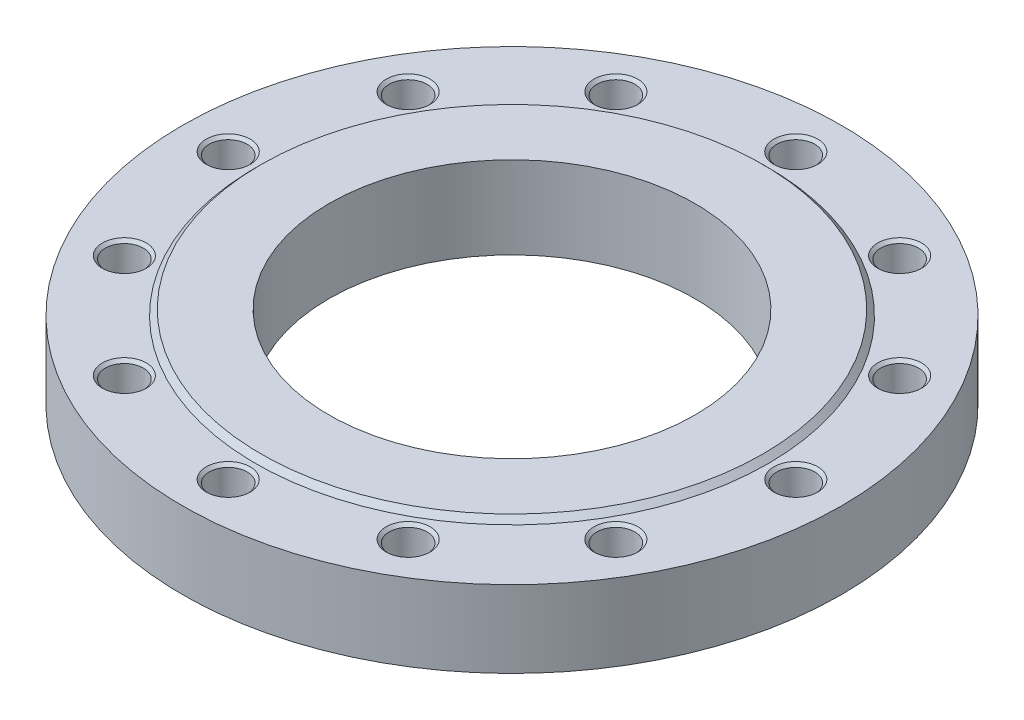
ISO-10303-21;
HEADER;
FILE_DESCRIPTION(('STEP AP214'),'2;1');
FILE_NAME('part.step','',(''),(''),'','','');
FILE_SCHEMA(('AUTOMOTIVE_DESIGN { 1 0 10303 214 1 1 1 1 }'));
ENDSEC;
DATA;
#1=APPLICATION_CONTEXT('core data for automotive mechanical design processes');
#2=APPLICATION_PROTOCOL_DEFINITION('international standard','automotive_design',2000,#1);
#3=PRODUCT_CONTEXT('',#1,'mechanical');
#4=PRODUCT('Part','Part','',(#3));
#5=PRODUCT_RELATED_PRODUCT_CATEGORY('part','',(#4));
#6=PRODUCT_DEFINITION_FORMATION('','',#4);
#7=PRODUCT_DEFINITION_CONTEXT('part definition',#1,'design');
#8=PRODUCT_DEFINITION('design','',#6,#7);
#9=PRODUCT_DEFINITION_SHAPE('','',#8);
#10=(LENGTH_UNIT() NAMED_UNIT(*) SI_UNIT(.MILLI.,.METRE.));
#11=(NAMED_UNIT(*) PLANE_ANGLE_UNIT() SI_UNIT($,.RADIAN.));
#12=(NAMED_UNIT(*) SI_UNIT($,.STERADIAN.) SOLID_ANGLE_UNIT());
#13=UNCERTAINTY_MEASURE_WITH_UNIT(LENGTH_MEASURE(1.E-05),#10,'distance_accuracy_value','');
#14=(GEOMETRIC_REPRESENTATION_CONTEXT(3) GLOBAL_UNCERTAINTY_ASSIGNED_CONTEXT((#13)) GLOBAL_UNIT_ASSIGNED_CONTEXT((#10,
#11,#12)) REPRESENTATION_CONTEXT('',''));
#15=CARTESIAN_POINT('',(0.,0.,0.));
#16=DIRECTION('',(0.,0.,1.));
#17=DIRECTION('',(1.,0.,0.));
#18=AXIS2_PLACEMENT_3D('',#15,#16,#17);
#19=CARTESIAN_POINT('',(0.,21.,0.));
#20=DIRECTION('',(0.,-1.,0.));
#21=DIRECTION('',(1.,0.,0.));
#22=AXIS2_PLACEMENT_3D('',#19,#20,#21);
#23=CYLINDRICAL_SURFACE('',#22,180.);
#24=CARTESIAN_POINT('',(0.,0.,0.));
#25=DIRECTION('',(0.,1.,0.));
#26=DIRECTION('',(1.,0.,0.));
#27=AXIS2_PLACEMENT_3D('',#24,#25,#26);
#28=CIRCLE('',#27,180.);
#29=CARTESIAN_POINT('',(180.,0.,0.));
#30=VERTEX_POINT('',#29);
#31=EDGE_CURVE('E9',#30,#30,#28,.T.);
#32=ORIENTED_EDGE('',*,*,#31,.T.);
#33=EDGE_LOOP('',(#32));
#34=FACE_BOUND('',#33,.T.);
#35=CARTESIAN_POINT('',(0.,42.,0.));
#36=DIRECTION('',(0.,1.,0.));
#37=DIRECTION('',(1.,0.,0.));
#38=AXIS2_PLACEMENT_3D('',#35,#36,#37);
#39=CIRCLE('',#38,180.);
#40=CARTESIAN_POINT('',(180.,42.,0.));
#41=VERTEX_POINT('',#40);
#42=EDGE_CURVE('E294',#41,#41,#39,.T.);
#43=ORIENTED_EDGE('',*,*,#42,.F.);
#44=EDGE_LOOP('',(#43));
#45=FACE_BOUND('',#44,.T.);
#46=ADVANCED_FACE('F15',(#34,#45),#23,.T.);
#47=CARTESIAN_POINT('',(140.,0.,0.));
#48=DIRECTION('',(0.,-1.,0.));
#49=DIRECTION('',(-1.,0.,0.));
#50=AXIS2_PLACEMENT_3D('',#47,#48,#49);
#51=PLANE('',#50);
#52=CARTESIAN_POINT('',(0.,0.,0.));
#53=DIRECTION('',(0.,1.,0.));
#54=DIRECTION('',(1.,0.,0.));
#55=AXIS2_PLACEMENT_3D('',#52,#53,#54);
#56=CIRCLE('',#55,100.);
#57=CARTESIAN_POINT('',(100.,0.,0.));
#58=VERTEX_POINT('',#57);
#59=EDGE_CURVE('E18',#58,#58,#56,.T.);
#60=ORIENTED_EDGE('',*,*,#59,.T.);
#61=EDGE_LOOP('',(#60));
#62=FACE_BOUND('',#61,.T.);
#63=ORIENTED_EDGE('',*,*,#31,.F.);
#64=EDGE_LOOP('',(#63));
#65=FACE_BOUND('',#64,.T.);
#66=ADVANCED_FACE('F505',(#62,#65),#51,.T.);
#67=CARTESIAN_POINT('',(0.,22.5,0.));
#68=DIRECTION('',(0.,-1.,0.));
#69=DIRECTION('',(1.,0.,0.));
#70=AXIS2_PLACEMENT_3D('',#67,#68,#69);
#71=CYLINDRICAL_SURFACE('',#70,100.);
#72=CARTESIAN_POINT('',(0.,45.,0.));
#73=DIRECTION('',(0.,1.,0.));
#74=DIRECTION('',(1.,0.,0.));
#75=AXIS2_PLACEMENT_3D('',#72,#73,#74);
#76=CIRCLE('',#75,100.);
#77=CARTESIAN_POINT('',(100.,45.,0.));
#78=VERTEX_POINT('',#77);
#79=EDGE_CURVE('E309',#78,#78,#76,.T.);
#80=ORIENTED_EDGE('',*,*,#79,.T.);
#81=EDGE_LOOP('',(#80));
#82=FACE_BOUND('',#81,.T.);
#83=ORIENTED_EDGE('',*,*,#59,.F.);
#84=EDGE_LOOP('',(#83));
#85=FACE_BOUND('',#84,.T.);
#86=ADVANCED_FACE('F509',(#82,#85),#71,.F.);
#87=CARTESIAN_POINT('',(118.5,45.,0.));
#88=DIRECTION('',(0.,1.,0.));
#89=DIRECTION('',(1.,0.,0.));
#90=AXIS2_PLACEMENT_3D('',#87,#88,#89);
#91=PLANE('',#90);
#92=CARTESIAN_POINT('',(0.,45.,0.));
#93=DIRECTION('',(0.,1.,0.));
#94=DIRECTION('',(1.,0.,0.));
#95=AXIS2_PLACEMENT_3D('',#92,#93,#94);
#96=CIRCLE('',#95,137.);
#97=CARTESIAN_POINT('',(137.,45.,0.));
#98=VERTEX_POINT('',#97);
#99=EDGE_CURVE('E297',#98,#98,#96,.T.);
#100=ORIENTED_EDGE('',*,*,#99,.T.);
#101=EDGE_LOOP('',(#100));
#102=FACE_BOUND('',#101,.T.);
#103=ORIENTED_EDGE('',*,*,#79,.F.);
#104=EDGE_LOOP('',(#103));
#105=FACE_BOUND('',#104,.T.);
#106=ADVANCED_FACE('F657',(#102,#105),#91,.T.);
#107=CARTESIAN_POINT('',(0.,43.5,0.));
#108=DIRECTION('',(0.,-1.,0.));
#109=DIRECTION('',(1.,0.,0.));
#110=AXIS2_PLACEMENT_3D('',#107,#108,#109);
#111=CONICAL_SURFACE('',#110,138.5,0.785398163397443);
#112=CARTESIAN_POINT('',(0.,42.,0.));
#113=DIRECTION('',(0.,1.,0.));
#114=DIRECTION('',(1.,0.,0.));
#115=AXIS2_PLACEMENT_3D('',#112,#113,#114);
#116=CIRCLE('',#115,140.);
#117=CARTESIAN_POINT('',(140.,42.,0.));
#118=VERTEX_POINT('',#117);
#119=EDGE_CURVE('E290',#118,#118,#116,.T.);
#120=ORIENTED_EDGE('',*,*,#119,.T.);
#121=EDGE_LOOP('',(#120));
#122=FACE_BOUND('',#121,.T.);
#123=ORIENTED_EDGE('',*,*,#99,.F.);
#124=EDGE_LOOP('',(#123));
#125=FACE_BOUND('',#124,.T.);
#126=ADVANCED_FACE('F291',(#122,#125),#111,.T.);
#127=CARTESIAN_POINT('',(160.,42.,0.));
#128=DIRECTION('',(0.,1.,0.));
#129=DIRECTION('',(1.,0.,0.));
#130=AXIS2_PLACEMENT_3D('',#127,#128,#129);
#131=PLANE('',#130);
#132=ORIENTED_EDGE('',*,*,#42,.T.);
#133=EDGE_LOOP('',(#132));
#134=FACE_BOUND('',#133,.T.);
#135=ORIENTED_EDGE('',*,*,#119,.F.);
#136=EDGE_LOOP('',(#135));
#137=FACE_BOUND('',#136,.T.);
#138=CARTESIAN_POINT('',(155.,42.,0.));
#139=DIRECTION('',(0.,-1.,0.));
#140=DIRECTION('',(1.,0.,0.));
#141=AXIS2_PLACEMENT_3D('',#138,#139,#140);
#142=CIRCLE('',#141,12.);
#143=CARTESIAN_POINT('',(167.,42.,0.));
#144=VERTEX_POINT('',#143);
#145=EDGE_CURVE('E375',#144,#144,#142,.T.);
#146=ORIENTED_EDGE('',*,*,#145,.T.);
#147=EDGE_LOOP('',(#146));
#148=FACE_BOUND('',#147,.T.);
#149=CARTESIAN_POINT('',(134.233937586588,42.,-77.5));
#150=DIRECTION('',(0.,-1.,0.));
#151=DIRECTION('',(0.866025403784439,0.,-0.5));
#152=AXIS2_PLACEMENT_3D('',#149,#150,#151);
#153=CIRCLE('',#152,12.);
#154=CARTESIAN_POINT('',(144.626242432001,42.,-83.5));
#155=VERTEX_POINT('',#154);
#156=EDGE_CURVE('E370',#155,#155,#153,.T.);
#157=ORIENTED_EDGE('',*,*,#156,.T.);
#158=EDGE_LOOP('',(#157));
#159=FACE_BOUND('',#158,.T.);
#160=CARTESIAN_POINT('',(77.5,42.,-134.233937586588));
#161=DIRECTION('',(0.,-1.,0.));
#162=DIRECTION('',(0.5,0.,-0.866025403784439));
#163=AXIS2_PLACEMENT_3D('',#160,#161,#162);
#164=CIRCLE('',#163,12.);
#165=CARTESIAN_POINT('',(83.5,42.,-144.626242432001));
#166=VERTEX_POINT('',#165);
#167=EDGE_CURVE('E358',#166,#166,#164,.T.);
#168=ORIENTED_EDGE('',*,*,#167,.T.);
#169=EDGE_LOOP('',(#168));
#170=FACE_BOUND('',#169,.T.);
#171=CARTESIAN_POINT('',(0.,42.,-155.));
#172=DIRECTION('',(0.,-1.,0.));
#173=DIRECTION('',(0.,0.,-1.));
#174=AXIS2_PLACEMENT_3D('',#171,#172,#173);
#175=CIRCLE('',#174,12.);
#176=CARTESIAN_POINT('',(0.,42.,-167.));
#177=VERTEX_POINT('',#176);
#178=EDGE_CURVE('E346',#177,#177,#175,.T.);
#179=ORIENTED_EDGE('',*,*,#178,.T.);
#180=EDGE_LOOP('',(#179));
#181=FACE_BOUND('',#180,.T.);
#182=CARTESIAN_POINT('',(-77.5,42.,-134.233937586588));
#183=DIRECTION('',(0.,-1.,0.));
#184=DIRECTION('',(-0.5,0.,-0.866025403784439));
#185=AXIS2_PLACEMENT_3D('',#182,#183,#184);
#186=CIRCLE('',#185,12.);
#187=CARTESIAN_POINT('',(-83.5,42.,-144.626242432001));
#188=VERTEX_POINT('',#187);
#189=EDGE_CURVE('E335',#188,#188,#186,.T.);
#190=ORIENTED_EDGE('',*,*,#189,.T.);
#191=EDGE_LOOP('',(#190));
#192=FACE_BOUND('',#191,.T.);
#193=CARTESIAN_POINT('',(-134.233937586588,42.,-77.5));
#194=DIRECTION('',(0.,-1.,0.));
#195=DIRECTION('',(-0.866025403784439,0.,-0.5));
#196=AXIS2_PLACEMENT_3D('',#193,#194,#195);
#197=CIRCLE('',#196,12.);
#198=CARTESIAN_POINT('',(-144.626242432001,42.,-83.5));
#199=VERTEX_POINT('',#198);
#200=EDGE_CURVE('E320',#199,#199,#197,.T.);
#201=ORIENTED_EDGE('',*,*,#200,.T.);
#202=EDGE_LOOP('',(#201));
#203=FACE_BOUND('',#202,.T.);
#204=CARTESIAN_POINT('',(-155.,42.,0.));
#205=DIRECTION('',(0.,-1.,0.));
#206=DIRECTION('',(-1.,0.,0.));
#207=AXIS2_PLACEMENT_3D('',#204,#205,#206);
#208=CIRCLE('',#207,12.);
#209=CARTESIAN_POINT('',(-167.,42.,0.));
#210=VERTEX_POINT('',#209);
#211=EDGE_CURVE('E306',#210,#210,#208,.T.);
#212=ORIENTED_EDGE('',*,*,#211,.T.);
#213=EDGE_LOOP('',(#212));
#214=FACE_BOUND('',#213,.T.);
#215=CARTESIAN_POINT('',(-134.233937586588,42.,77.5));
#216=DIRECTION('',(0.,-1.,0.));
#217=DIRECTION('',(-0.866025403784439,0.,0.5));
#218=AXIS2_PLACEMENT_3D('',#215,#216,#217);
#219=CIRCLE('',#218,12.);
#220=CARTESIAN_POINT('',(-144.626242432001,42.,83.5));
#221=VERTEX_POINT('',#220);
#222=EDGE_CURVE('E391',#221,#221,#219,.T.);
#223=ORIENTED_EDGE('',*,*,#222,.T.);
#224=EDGE_LOOP('',(#223));
#225=FACE_BOUND('',#224,.T.);
#226=CARTESIAN_POINT('',(-77.5,42.,134.233937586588));
#227=DIRECTION('',(0.,-1.,0.));
#228=DIRECTION('',(-0.5,0.,0.866025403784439));
#229=AXIS2_PLACEMENT_3D('',#226,#227,#228);
#230=CIRCLE('',#229,12.);
#231=CARTESIAN_POINT('',(-83.5,42.,144.626242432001));
#232=VERTEX_POINT('',#231);
#233=EDGE_CURVE('E424',#232,#232,#230,.T.);
#234=ORIENTED_EDGE('',*,*,#233,.T.);
#235=EDGE_LOOP('',(#234));
#236=FACE_BOUND('',#235,.T.);
#237=CARTESIAN_POINT('',(0.,42.,155.));
#238=DIRECTION('',(0.,-1.,0.));
#239=DIRECTION('',(0.,0.,1.));
#240=AXIS2_PLACEMENT_3D('',#237,#238,#239);
#241=CIRCLE('',#240,12.);
#242=CARTESIAN_POINT('',(0.,42.,167.));
#243=VERTEX_POINT('',#242);
#244=EDGE_CURVE('E414',#243,#243,#241,.T.);
#245=ORIENTED_EDGE('',*,*,#244,.T.);
#246=EDGE_LOOP('',(#245));
#247=FACE_BOUND('',#246,.T.);
#248=CARTESIAN_POINT('',(77.5,42.,134.233937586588));
#249=DIRECTION('',(0.,-1.,0.));
#250=DIRECTION('',(0.5,0.,0.866025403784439));
#251=AXIS2_PLACEMENT_3D('',#248,#249,#250);
#252=CIRCLE('',#251,12.);
#253=CARTESIAN_POINT('',(83.5,42.,144.626242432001));
#254=VERTEX_POINT('',#253);
#255=EDGE_CURVE('E438',#254,#254,#252,.T.);
#256=ORIENTED_EDGE('',*,*,#255,.T.);
#257=EDGE_LOOP('',(#256));
#258=FACE_BOUND('',#257,.T.);
#259=CARTESIAN_POINT('',(134.233937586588,42.,77.5));
#260=DIRECTION('',(0.,-1.,0.));
#261=DIRECTION('',(0.866025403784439,0.,0.5));
#262=AXIS2_PLACEMENT_3D('',#259,#260,#261);
#263=CIRCLE('',#262,12.);
#264=CARTESIAN_POINT('',(144.626242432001,42.,83.5));
#265=VERTEX_POINT('',#264);
#266=EDGE_CURVE('E449',#265,#265,#263,.T.);
#267=ORIENTED_EDGE('',*,*,#266,.T.);
#268=EDGE_LOOP('',(#267));
#269=FACE_BOUND('',#268,.T.);
#270=ADVANCED_FACE('F514',(#134,#137,#148,#159,#170,#181,#192,#203,#214,#225,#236,#247,#258,
#269),#131,.T.);
#271=CARTESIAN_POINT('',(155.,6.00463463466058,0.));
#272=DIRECTION('',(0.,1.,0.));
#273=DIRECTION('',(1.,0.,0.));
#274=AXIS2_PLACEMENT_3D('',#271,#272,#273);
#275=CONICAL_SURFACE('',#274,5.188125,1.0471975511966);
#276=CARTESIAN_POINT('',(155.,9.,0.));
#277=DIRECTION('',(0.,-1.,0.));
#278=DIRECTION('',(1.,0.,0.));
#279=AXIS2_PLACEMENT_3D('',#276,#277,#278);
#280=CIRCLE('',#279,10.37625);
#281=CARTESIAN_POINT('',(165.37625,9.,0.));
#282=VERTEX_POINT('',#281);
#283=EDGE_CURVE('E295',#282,#282,#280,.T.);
#284=ORIENTED_EDGE('',*,*,#283,.F.);
#285=EDGE_LOOP('',(#284));
#286=FACE_BOUND('',#285,.T.);
#287=CARTESIAN_POINT('',(155.,3.00926926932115,0.));
#288=VERTEX_POINT('',#287);
#289=VERTEX_LOOP('',#288);
#290=FACE_BOUND('',#289,.T.);
#291=ADVANCED_FACE('F516',(#286,#290),#275,.F.);
#292=CARTESIAN_POINT('',(155.,12.688125,0.));
#293=DIRECTION('',(0.,1.,0.));
#294=DIRECTION('',(1.,0.,0.));
#295=AXIS2_PLACEMENT_3D('',#292,#293,#294);
#296=CYLINDRICAL_SURFACE('',#295,10.37625);
#297=CARTESIAN_POINT('',(155.,16.37625,0.));
#298=DIRECTION('',(0.,-1.,0.));
#299=DIRECTION('',(1.,0.,0.));
#300=AXIS2_PLACEMENT_3D('',#297,#298,#299);
#301=CIRCLE('',#300,10.37625);
#302=CARTESIAN_POINT('',(165.37625,16.37625,0.));
#303=VERTEX_POINT('',#302);
#304=EDGE_CURVE('E299',#303,#303,#301,.T.);
#305=ORIENTED_EDGE('',*,*,#304,.F.);
#306=EDGE_LOOP('',(#305));
#307=FACE_BOUND('',#306,.T.);
#308=ORIENTED_EDGE('',*,*,#283,.T.);
#309=EDGE_LOOP('',(#308));
#310=FACE_BOUND('',#309,.T.);
#311=ADVANCED_FACE('F653',(#307,#310),#296,.F.);
#312=CARTESIAN_POINT('',(155.,17.188125,0.));
#313=DIRECTION('',(0.,1.,0.));
#314=DIRECTION('',(1.,0.,0.));
#315=AXIS2_PLACEMENT_3D('',#312,#313,#314);
#316=CONICAL_SURFACE('',#315,11.188125,0.785398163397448);
#317=CARTESIAN_POINT('',(155.,18.,0.));
#318=DIRECTION('',(0.,-1.,0.));
#319=DIRECTION('',(1.,0.,0.));
#320=AXIS2_PLACEMENT_3D('',#317,#318,#319);
#321=CIRCLE('',#320,12.);
#322=CARTESIAN_POINT('',(167.,18.,0.));
#323=VERTEX_POINT('',#322);
#324=EDGE_CURVE('E379',#323,#323,#321,.T.);
#325=ORIENTED_EDGE('',*,*,#324,.F.);
#326=EDGE_LOOP('',(#325));
#327=FACE_BOUND('',#326,.T.);
#328=ORIENTED_EDGE('',*,*,#304,.T.);
#329=EDGE_LOOP('',(#328));
#330=FACE_BOUND('',#329,.T.);
#331=ADVANCED_FACE('F650',(#327,#330),#316,.F.);
#332=CARTESIAN_POINT('',(166.188125,18.,0.));
#333=DIRECTION('',(0.,1.,0.));
#334=DIRECTION('',(-1.,0.,0.));
#335=AXIS2_PLACEMENT_3D('',#332,#333,#334);
#336=PLANE('',#335);
#337=CARTESIAN_POINT('',(155.,18.,0.));
#338=DIRECTION('',(0.,-1.,0.));
#339=DIRECTION('',(1.,0.,0.));
#340=AXIS2_PLACEMENT_3D('',#337,#338,#339);
#341=CIRCLE('',#340,10.37625);
#342=CARTESIAN_POINT('',(165.37625,18.,0.));
#343=VERTEX_POINT('',#342);
#344=EDGE_CURVE('E378',#343,#343,#341,.T.);
#345=ORIENTED_EDGE('',*,*,#344,.F.);
#346=EDGE_LOOP('',(#345));
#347=FACE_BOUND('',#346,.T.);
#348=ORIENTED_EDGE('',*,*,#324,.T.);
#349=EDGE_LOOP('',(#348));
#350=FACE_BOUND('',#349,.T.);
#351=ADVANCED_FACE('F646',(#347,#350),#336,.F.);
#352=CARTESIAN_POINT('',(155.,29.188125,0.));
#353=DIRECTION('',(0.,1.,0.));
#354=DIRECTION('',(1.,0.,0.));
#355=AXIS2_PLACEMENT_3D('',#352,#353,#354);
#356=CYLINDRICAL_SURFACE('',#355,10.37625);
#357=CARTESIAN_POINT('',(155.,40.37625,0.));
#358=DIRECTION('',(0.,-1.,0.));
#359=DIRECTION('',(1.,0.,0.));
#360=AXIS2_PLACEMENT_3D('',#357,#358,#359);
#361=CIRCLE('',#360,10.37625);
#362=CARTESIAN_POINT('',(165.37625,40.37625,0.));
#363=VERTEX_POINT('',#362);
#364=EDGE_CURVE('E373',#363,#363,#361,.T.);
#365=ORIENTED_EDGE('',*,*,#364,.F.);
#366=EDGE_LOOP('',(#365));
#367=FACE_BOUND('',#366,.T.);
#368=ORIENTED_EDGE('',*,*,#344,.T.);
#369=EDGE_LOOP('',(#368));
#370=FACE_BOUND('',#369,.T.);
#371=ADVANCED_FACE('F638',(#367,#370),#356,.F.);
#372=CARTESIAN_POINT('',(155.,41.188125,0.));
#373=DIRECTION('',(0.,1.,0.));
#374=DIRECTION('',(1.,0.,0.));
#375=AXIS2_PLACEMENT_3D('',#372,#373,#374);
#376=CONICAL_SURFACE('',#375,11.188125,0.785398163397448);
#377=ORIENTED_EDGE('',*,*,#145,.F.);
#378=EDGE_LOOP('',(#377));
#379=FACE_BOUND('',#378,.T.);
#380=ORIENTED_EDGE('',*,*,#364,.T.);
#381=EDGE_LOOP('',(#380));
#382=FACE_BOUND('',#381,.T.);
#383=ADVANCED_FACE('F633',(#379,#382),#376,.F.);
#384=CARTESIAN_POINT('',(134.233937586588,6.00463463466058,-77.5));
#385=DIRECTION('',(0.,1.,0.));
#386=DIRECTION('',(0.866025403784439,0.,-0.5));
#387=AXIS2_PLACEMENT_3D('',#384,#385,#386);
#388=CONICAL_SURFACE('',#387,5.188125,1.0471975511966);
#389=CARTESIAN_POINT('',(134.233937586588,9.,-77.5));
#390=DIRECTION('',(0.,-1.,0.));
#391=DIRECTION('',(0.866025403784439,0.,-0.5));
#392=AXIS2_PLACEMENT_3D('',#389,#390,#391);
#393=CIRCLE('',#392,10.37625);
#394=CARTESIAN_POINT('',(143.220033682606,9.,-82.688125));
#395=VERTEX_POINT('',#394);
#396=EDGE_CURVE('E376',#395,#395,#393,.T.);
#397=ORIENTED_EDGE('',*,*,#396,.F.);
#398=EDGE_LOOP('',(#397));
#399=FACE_BOUND('',#398,.T.);
#400=CARTESIAN_POINT('',(134.233937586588,3.00926926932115,-77.5));
#401=VERTEX_POINT('',#400);
#402=VERTEX_LOOP('',#401);
#403=FACE_BOUND('',#402,.T.);
#404=ADVANCED_FACE('F622',(#399,#403),#388,.F.);
#405=CARTESIAN_POINT('',(134.233937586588,12.688125,-77.5));
#406=DIRECTION('',(0.,1.,0.));
#407=DIRECTION('',(0.866025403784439,0.,-0.5));
#408=AXIS2_PLACEMENT_3D('',#405,#406,#407);
#409=CYLINDRICAL_SURFACE('',#408,10.37625);
#410=CARTESIAN_POINT('',(134.233937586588,16.37625,-77.5));
#411=DIRECTION('',(0.,-1.,0.));
#412=DIRECTION('',(0.866025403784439,0.,-0.5));
#413=AXIS2_PLACEMENT_3D('',#410,#411,#412);
#414=CIRCLE('',#413,10.37625);
#415=CARTESIAN_POINT('',(143.220033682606,16.37625,-82.688125));
#416=VERTEX_POINT('',#415);
#417=EDGE_CURVE('E323',#416,#416,#414,.T.);
#418=ORIENTED_EDGE('',*,*,#417,.F.);
#419=EDGE_LOOP('',(#418));
#420=FACE_BOUND('',#419,.T.);
#421=ORIENTED_EDGE('',*,*,#396,.T.);
#422=EDGE_LOOP('',(#421));
#423=FACE_BOUND('',#422,.T.);
#424=ADVANCED_FACE('F613',(#420,#423),#409,.F.);
#425=CARTESIAN_POINT('',(134.233937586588,17.188125,-77.5));
#426=DIRECTION('',(0.,1.,0.));
#427=DIRECTION('',(0.866025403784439,0.,-0.5));
#428=AXIS2_PLACEMENT_3D('',#425,#426,#427);
#429=CONICAL_SURFACE('',#428,11.188125,0.785398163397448);
#430=CARTESIAN_POINT('',(134.233937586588,18.,-77.5));
#431=DIRECTION('',(0.,-1.,0.));
#432=DIRECTION('',(0.866025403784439,0.,-0.5));
#433=AXIS2_PLACEMENT_3D('',#430,#431,#432);
#434=CIRCLE('',#433,12.);
#435=CARTESIAN_POINT('',(144.626242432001,18.,-83.5));
#436=VERTEX_POINT('',#435);
#437=EDGE_CURVE('E321',#436,#436,#434,.T.);
#438=ORIENTED_EDGE('',*,*,#437,.F.);
#439=EDGE_LOOP('',(#438));
#440=FACE_BOUND('',#439,.T.);
#441=ORIENTED_EDGE('',*,*,#417,.T.);
#442=EDGE_LOOP('',(#441));
#443=FACE_BOUND('',#442,.T.);
#444=ADVANCED_FACE('F610',(#440,#443),#429,.F.);
#445=CARTESIAN_POINT('',(143.923138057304,18.,-83.0940625));
#446=DIRECTION('',(0.,1.,0.));
#447=DIRECTION('',(-0.866025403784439,0.,0.5));
#448=AXIS2_PLACEMENT_3D('',#445,#446,#447);
#449=PLANE('',#448);
#450=CARTESIAN_POINT('',(134.233937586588,18.,-77.5));
#451=DIRECTION('',(0.,-1.,0.));
#452=DIRECTION('',(0.866025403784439,0.,-0.5));
#453=AXIS2_PLACEMENT_3D('',#450,#451,#452);
#454=CIRCLE('',#453,10.37625);
#455=CARTESIAN_POINT('',(143.220033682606,18.,-82.688125));
#456=VERTEX_POINT('',#455);
#457=EDGE_CURVE('E324',#456,#456,#454,.T.);
#458=ORIENTED_EDGE('',*,*,#457,.F.);
#459=EDGE_LOOP('',(#458));
#460=FACE_BOUND('',#459,.T.);
#461=ORIENTED_EDGE('',*,*,#437,.T.);
#462=EDGE_LOOP('',(#461));
#463=FACE_BOUND('',#462,.T.);
#464=ADVANCED_FACE('F612',(#460,#463),#449,.F.);
#465=CARTESIAN_POINT('',(134.233937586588,29.188125,-77.5));
#466=DIRECTION('',(0.,1.,0.));
#467=DIRECTION('',(0.866025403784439,0.,-0.5));
#468=AXIS2_PLACEMENT_3D('',#465,#466,#467);
#469=CYLINDRICAL_SURFACE('',#468,10.37625);
#470=CARTESIAN_POINT('',(134.233937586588,40.37625,-77.5));
#471=DIRECTION('',(0.,-1.,0.));
#472=DIRECTION('',(0.866025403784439,0.,-0.5));
#473=AXIS2_PLACEMENT_3D('',#470,#471,#472);
#474=CIRCLE('',#473,10.37625);
#475=CARTESIAN_POINT('',(143.220033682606,40.37625,-82.688125));
#476=VERTEX_POINT('',#475);
#477=EDGE_CURVE('E368',#476,#476,#474,.T.);
#478=ORIENTED_EDGE('',*,*,#477,.F.);
#479=EDGE_LOOP('',(#478));
#480=FACE_BOUND('',#479,.T.);
#481=ORIENTED_EDGE('',*,*,#457,.T.);
#482=EDGE_LOOP('',(#481));
#483=FACE_BOUND('',#482,.T.);
#484=ADVANCED_FACE('F619',(#480,#483),#469,.F.);
#485=CARTESIAN_POINT('',(134.233937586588,41.188125,-77.5));
#486=DIRECTION('',(0.,1.,0.));
#487=DIRECTION('',(0.866025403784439,0.,-0.5));
#488=AXIS2_PLACEMENT_3D('',#485,#486,#487);
#489=CONICAL_SURFACE('',#488,11.188125,0.785398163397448);
#490=ORIENTED_EDGE('',*,*,#156,.F.);
#491=EDGE_LOOP('',(#490));
#492=FACE_BOUND('',#491,.T.);
#493=ORIENTED_EDGE('',*,*,#477,.T.);
#494=EDGE_LOOP('',(#493));
#495=FACE_BOUND('',#494,.T.);
#496=ADVANCED_FACE('F1150',(#492,#495),#489,.F.);
#497=CARTESIAN_POINT('',(77.5,6.00463463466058,-134.233937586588));
#498=DIRECTION('',(0.,1.,0.));
#499=DIRECTION('',(0.5,0.,-0.866025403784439));
#500=AXIS2_PLACEMENT_3D('',#497,#498,#499);
#501=CONICAL_SURFACE('',#500,5.188125,1.0471975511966);
#502=CARTESIAN_POINT('',(77.5,9.,-134.233937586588));
#503=DIRECTION('',(0.,-1.,0.));
#504=DIRECTION('',(0.5,0.,-0.866025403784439));
#505=AXIS2_PLACEMENT_3D('',#502,#503,#504);
#506=CIRCLE('',#505,10.37625);
#507=CARTESIAN_POINT('',(82.688125,9.,-143.220033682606));
#508=VERTEX_POINT('',#507);
#509=EDGE_CURVE('E366',#508,#508,#506,.T.);
#510=ORIENTED_EDGE('',*,*,#509,.F.);
#511=EDGE_LOOP('',(#510));
#512=FACE_BOUND('',#511,.T.);
#513=CARTESIAN_POINT('',(77.5,3.00926926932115,-134.233937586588));
#514=VERTEX_POINT('',#513);
#515=VERTEX_LOOP('',#514);
#516=FACE_BOUND('',#515,.T.);
#517=ADVANCED_FACE('F1141',(#512,#516),#501,.F.);
#518=CARTESIAN_POINT('',(77.5,12.688125,-134.233937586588));
#519=DIRECTION('',(0.,1.,0.));
#520=DIRECTION('',(0.5,0.,-0.866025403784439));
#521=AXIS2_PLACEMENT_3D('',#518,#519,#520);
#522=CYLINDRICAL_SURFACE('',#521,10.37625);
#523=CARTESIAN_POINT('',(77.5,16.37625,-134.233937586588));
#524=DIRECTION('',(0.,-1.,0.));
#525=DIRECTION('',(0.5,0.,-0.866025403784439));
#526=AXIS2_PLACEMENT_3D('',#523,#524,#525);
#527=CIRCLE('',#526,10.37625);
#528=CARTESIAN_POINT('',(82.688125,16.37625,-143.220033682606));
#529=VERTEX_POINT('',#528);
#530=EDGE_CURVE('E364',#529,#529,#527,.T.);
#531=ORIENTED_EDGE('',*,*,#530,.F.);
#532=EDGE_LOOP('',(#531));
#533=FACE_BOUND('',#532,.T.);
#534=ORIENTED_EDGE('',*,*,#509,.T.);
#535=EDGE_LOOP('',(#534));
#536=FACE_BOUND('',#535,.T.);
#537=ADVANCED_FACE('F1132',(#533,#536),#522,.F.);
#538=CARTESIAN_POINT('',(77.5,17.188125,-134.233937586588));
#539=DIRECTION('',(0.,1.,0.));
#540=DIRECTION('',(0.5,0.,-0.866025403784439));
#541=AXIS2_PLACEMENT_3D('',#538,#539,#540);
#542=CONICAL_SURFACE('',#541,11.188125,0.785398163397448);
#543=CARTESIAN_POINT('',(77.5,18.,-134.233937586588));
#544=DIRECTION('',(0.,-1.,0.));
#545=DIRECTION('',(0.5,0.,-0.866025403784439));
#546=AXIS2_PLACEMENT_3D('',#543,#544,#545);
#547=CIRCLE('',#546,12.);
#548=CARTESIAN_POINT('',(83.5,18.,-144.626242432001));
#549=VERTEX_POINT('',#548);
#550=EDGE_CURVE('E362',#549,#549,#547,.T.);
#551=ORIENTED_EDGE('',*,*,#550,.F.);
#552=EDGE_LOOP('',(#551));
#553=FACE_BOUND('',#552,.T.);
#554=ORIENTED_EDGE('',*,*,#530,.T.);
#555=EDGE_LOOP('',(#554));
#556=FACE_BOUND('',#555,.T.);
#557=ADVANCED_FACE('F1123',(#553,#556),#542,.F.);
#558=CARTESIAN_POINT('',(83.0940625,18.,-143.923138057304));
#559=DIRECTION('',(0.,1.,0.));
#560=DIRECTION('',(-0.5,0.,0.866025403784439));
#561=AXIS2_PLACEMENT_3D('',#558,#559,#560);
#562=PLANE('',#561);
#563=CARTESIAN_POINT('',(77.5,18.,-134.233937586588));
#564=DIRECTION('',(0.,-1.,0.));
#565=DIRECTION('',(0.5,0.,-0.866025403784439));
#566=AXIS2_PLACEMENT_3D('',#563,#564,#565);
#567=CIRCLE('',#566,10.37625);
#568=CARTESIAN_POINT('',(82.688125,18.,-143.220033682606));
#569=VERTEX_POINT('',#568);
#570=EDGE_CURVE('E360',#569,#569,#567,.T.);
#571=ORIENTED_EDGE('',*,*,#570,.F.);
#572=EDGE_LOOP('',(#571));
#573=FACE_BOUND('',#572,.T.);
#574=ORIENTED_EDGE('',*,*,#550,.T.);
#575=EDGE_LOOP('',(#574));
#576=FACE_BOUND('',#575,.T.);
#577=ADVANCED_FACE('F1114',(#573,#576),#562,.F.);
#578=CARTESIAN_POINT('',(77.5,29.188125,-134.233937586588));
#579=DIRECTION('',(0.,1.,0.));
#580=DIRECTION('',(0.5,0.,-0.866025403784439));
#581=AXIS2_PLACEMENT_3D('',#578,#579,#580);
#582=CYLINDRICAL_SURFACE('',#581,10.37625);
#583=CARTESIAN_POINT('',(77.5,40.37625,-134.233937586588));
#584=DIRECTION('',(0.,-1.,0.));
#585=DIRECTION('',(0.5,0.,-0.866025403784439));
#586=AXIS2_PLACEMENT_3D('',#583,#584,#585);
#587=CIRCLE('',#586,10.37625);
#588=CARTESIAN_POINT('',(82.688125,40.37625,-143.220033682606));
#589=VERTEX_POINT('',#588);
#590=EDGE_CURVE('E356',#589,#589,#587,.T.);
#591=ORIENTED_EDGE('',*,*,#590,.F.);
#592=EDGE_LOOP('',(#591));
#593=FACE_BOUND('',#592,.T.);
#594=ORIENTED_EDGE('',*,*,#570,.T.);
#595=EDGE_LOOP('',(#594));
#596=FACE_BOUND('',#595,.T.);
#597=ADVANCED_FACE('F1105',(#593,#596),#582,.F.);
#598=CARTESIAN_POINT('',(77.5,41.188125,-134.233937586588));
#599=DIRECTION('',(0.,1.,0.));
#600=DIRECTION('',(0.5,0.,-0.866025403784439));
#601=AXIS2_PLACEMENT_3D('',#598,#599,#600);
#602=CONICAL_SURFACE('',#601,11.188125,0.785398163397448);
#603=ORIENTED_EDGE('',*,*,#167,.F.);
#604=EDGE_LOOP('',(#603));
#605=FACE_BOUND('',#604,.T.);
#606=ORIENTED_EDGE('',*,*,#590,.T.);
#607=EDGE_LOOP('',(#606));
#608=FACE_BOUND('',#607,.T.);
#609=ADVANCED_FACE('F1096',(#605,#608),#602,.F.);
#610=CARTESIAN_POINT('',(0.,6.00463463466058,-155.));
#611=DIRECTION('',(0.,1.,0.));
#612=DIRECTION('',(0.,0.,-1.));
#613=AXIS2_PLACEMENT_3D('',#610,#611,#612);
#614=CONICAL_SURFACE('',#613,5.188125,1.0471975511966);
#615=CARTESIAN_POINT('',(0.,9.,-155.));
#616=DIRECTION('',(0.,-1.,0.));
#617=DIRECTION('',(0.,0.,-1.));
#618=AXIS2_PLACEMENT_3D('',#615,#616,#617);
#619=CIRCLE('',#618,10.37625);
#620=CARTESIAN_POINT('',(0.,9.,-165.37625));
#621=VERTEX_POINT('',#620);
#622=EDGE_CURVE('E354',#621,#621,#619,.T.);
#623=ORIENTED_EDGE('',*,*,#622,.F.);
#624=EDGE_LOOP('',(#623));
#625=FACE_BOUND('',#624,.T.);
#626=CARTESIAN_POINT('',(0.,3.00926926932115,-155.));
#627=VERTEX_POINT('',#626);
#628=VERTEX_LOOP('',#627);
#629=FACE_BOUND('',#628,.T.);
#630=ADVANCED_FACE('F1087',(#625,#629),#614,.F.);
#631=CARTESIAN_POINT('',(0.,12.688125,-155.));
#632=DIRECTION('',(0.,1.,0.));
#633=DIRECTION('',(0.,0.,-1.));
#634=AXIS2_PLACEMENT_3D('',#631,#632,#633);
#635=CYLINDRICAL_SURFACE('',#634,10.37625);
#636=CARTESIAN_POINT('',(0.,16.37625,-155.));
#637=DIRECTION('',(0.,-1.,0.));
#638=DIRECTION('',(0.,0.,-1.));
#639=AXIS2_PLACEMENT_3D('',#636,#637,#638);
#640=CIRCLE('',#639,10.37625);
#641=CARTESIAN_POINT('',(0.,16.37625,-165.37625));
#642=VERTEX_POINT('',#641);
#643=EDGE_CURVE('E352',#642,#642,#640,.T.);
#644=ORIENTED_EDGE('',*,*,#643,.F.);
#645=EDGE_LOOP('',(#644));
#646=FACE_BOUND('',#645,.T.);
#647=ORIENTED_EDGE('',*,*,#622,.T.);
#648=EDGE_LOOP('',(#647));
#649=FACE_BOUND('',#648,.T.);
#650=ADVANCED_FACE('F1078',(#646,#649),#635,.F.);
#651=CARTESIAN_POINT('',(0.,17.188125,-155.));
#652=DIRECTION('',(0.,1.,0.));
#653=DIRECTION('',(0.,0.,-1.));
#654=AXIS2_PLACEMENT_3D('',#651,#652,#653);
#655=CONICAL_SURFACE('',#654,11.188125,0.785398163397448);
#656=CARTESIAN_POINT('',(0.,18.,-155.));
#657=DIRECTION('',(0.,-1.,0.));
#658=DIRECTION('',(0.,0.,-1.));
#659=AXIS2_PLACEMENT_3D('',#656,#657,#658);
#660=CIRCLE('',#659,12.);
#661=CARTESIAN_POINT('',(0.,18.,-167.));
#662=VERTEX_POINT('',#661);
#663=EDGE_CURVE('E350',#662,#662,#660,.T.);
#664=ORIENTED_EDGE('',*,*,#663,.F.);
#665=EDGE_LOOP('',(#664));
#666=FACE_BOUND('',#665,.T.);
#667=ORIENTED_EDGE('',*,*,#643,.T.);
#668=EDGE_LOOP('',(#667));
#669=FACE_BOUND('',#668,.T.);
#670=ADVANCED_FACE('F1069',(#666,#669),#655,.F.);
#671=CARTESIAN_POINT('',(0.,18.,-166.188125));
#672=DIRECTION('',(0.,1.,0.));
#673=DIRECTION('',(0.,0.,1.));
#674=AXIS2_PLACEMENT_3D('',#671,#672,#673);
#675=PLANE('',#674);
#676=CARTESIAN_POINT('',(0.,18.,-155.));
#677=DIRECTION('',(0.,-1.,0.));
#678=DIRECTION('',(0.,0.,-1.));
#679=AXIS2_PLACEMENT_3D('',#676,#677,#678);
#680=CIRCLE('',#679,10.37625);
#681=CARTESIAN_POINT('',(0.,18.,-165.37625));
#682=VERTEX_POINT('',#681);
#683=EDGE_CURVE('E348',#682,#682,#680,.T.);
#684=ORIENTED_EDGE('',*,*,#683,.F.);
#685=EDGE_LOOP('',(#684));
#686=FACE_BOUND('',#685,.T.);
#687=ORIENTED_EDGE('',*,*,#663,.T.);
#688=EDGE_LOOP('',(#687));
#689=FACE_BOUND('',#688,.T.);
#690=ADVANCED_FACE('F1060',(#686,#689),#675,.F.);
#691=CARTESIAN_POINT('',(0.,29.188125,-155.));
#692=DIRECTION('',(0.,1.,0.));
#693=DIRECTION('',(0.,0.,-1.));
#694=AXIS2_PLACEMENT_3D('',#691,#692,#693);
#695=CYLINDRICAL_SURFACE('',#694,10.37625);
#696=CARTESIAN_POINT('',(0.,40.37625,-155.));
#697=DIRECTION('',(0.,-1.,0.));
#698=DIRECTION('',(0.,0.,-1.));
#699=AXIS2_PLACEMENT_3D('',#696,#697,#698);
#700=CIRCLE('',#699,10.37625);
#701=CARTESIAN_POINT('',(0.,40.37625,-165.37625));
#702=VERTEX_POINT('',#701);
#703=EDGE_CURVE('E344',#702,#702,#700,.T.);
#704=ORIENTED_EDGE('',*,*,#703,.F.);
#705=EDGE_LOOP('',(#704));
#706=FACE_BOUND('',#705,.T.);
#707=ORIENTED_EDGE('',*,*,#683,.T.);
#708=EDGE_LOOP('',(#707));
#709=FACE_BOUND('',#708,.T.);
#710=ADVANCED_FACE('F1052',(#706,#709),#695,.F.);
#711=CARTESIAN_POINT('',(0.,41.188125,-155.));
#712=DIRECTION('',(0.,1.,0.));
#713=DIRECTION('',(0.,0.,-1.));
#714=AXIS2_PLACEMENT_3D('',#711,#712,#713);
#715=CONICAL_SURFACE('',#714,11.188125,0.785398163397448);
#716=ORIENTED_EDGE('',*,*,#178,.F.);
#717=EDGE_LOOP('',(#716));
#718=FACE_BOUND('',#717,.T.);
#719=ORIENTED_EDGE('',*,*,#703,.T.);
#720=EDGE_LOOP('',(#719));
#721=FACE_BOUND('',#720,.T.);
#722=ADVANCED_FACE('F588',(#718,#721),#715,.F.);
#723=CARTESIAN_POINT('',(-77.5,6.00463463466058,-134.233937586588));
#724=DIRECTION('',(0.,1.,0.));
#725=DIRECTION('',(-0.5,0.,-0.866025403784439));
#726=AXIS2_PLACEMENT_3D('',#723,#724,#725);
#727=CONICAL_SURFACE('',#726,5.188125,1.0471975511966);
#728=CARTESIAN_POINT('',(-77.5,9.,-134.233937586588));
#729=DIRECTION('',(0.,-1.,0.));
#730=DIRECTION('',(-0.5,0.,-0.866025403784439));
#731=AXIS2_PLACEMENT_3D('',#728,#729,#730);
#732=CIRCLE('',#731,10.37625);
#733=CARTESIAN_POINT('',(-82.688125,9.,-143.220033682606));
#734=VERTEX_POINT('',#733);
#735=EDGE_CURVE('E342',#734,#734,#732,.T.);
#736=ORIENTED_EDGE('',*,*,#735,.F.);
#737=EDGE_LOOP('',(#736));
#738=FACE_BOUND('',#737,.T.);
#739=CARTESIAN_POINT('',(-77.5,3.00926926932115,-134.233937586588));
#740=VERTEX_POINT('',#739);
#741=VERTEX_LOOP('',#740);
#742=FACE_BOUND('',#741,.T.);
#743=ADVANCED_FACE('F1035',(#738,#742),#727,.F.);
#744=CARTESIAN_POINT('',(-77.5,12.688125,-134.233937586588));
#745=DIRECTION('',(0.,1.,0.));
#746=DIRECTION('',(-0.5,0.,-0.866025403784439));
#747=AXIS2_PLACEMENT_3D('',#744,#745,#746);
#748=CYLINDRICAL_SURFACE('',#747,10.37625);
#749=CARTESIAN_POINT('',(-77.5,16.37625,-134.233937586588));
#750=DIRECTION('',(0.,-1.,0.));
#751=DIRECTION('',(-0.5,0.,-0.866025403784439));
#752=AXIS2_PLACEMENT_3D('',#749,#750,#751);
#753=CIRCLE('',#752,10.37625);
#754=CARTESIAN_POINT('',(-82.688125,16.37625,-143.220033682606));
#755=VERTEX_POINT('',#754);
#756=EDGE_CURVE('E340',#755,#755,#753,.T.);
#757=ORIENTED_EDGE('',*,*,#756,.F.);
#758=EDGE_LOOP('',(#757));
#759=FACE_BOUND('',#758,.T.);
#760=ORIENTED_EDGE('',*,*,#735,.T.);
#761=EDGE_LOOP('',(#760));
#762=FACE_BOUND('',#761,.T.);
#763=ADVANCED_FACE('F1026',(#759,#762),#748,.F.);
#764=CARTESIAN_POINT('',(-77.5,17.188125,-134.233937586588));
#765=DIRECTION('',(0.,1.,0.));
#766=DIRECTION('',(-0.5,0.,-0.866025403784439));
#767=AXIS2_PLACEMENT_3D('',#764,#765,#766);
#768=CONICAL_SURFACE('',#767,11.188125,0.785398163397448);
#769=CARTESIAN_POINT('',(-77.5,18.,-134.233937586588));
#770=DIRECTION('',(0.,-1.,0.));
#771=DIRECTION('',(-0.5,0.,-0.866025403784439));
#772=AXIS2_PLACEMENT_3D('',#769,#770,#771);
#773=CIRCLE('',#772,12.);
#774=CARTESIAN_POINT('',(-83.5,18.,-144.626242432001));
#775=VERTEX_POINT('',#774);
#776=EDGE_CURVE('E338',#775,#775,#773,.T.);
#777=ORIENTED_EDGE('',*,*,#776,.F.);
#778=EDGE_LOOP('',(#777));
#779=FACE_BOUND('',#778,.T.);
#780=ORIENTED_EDGE('',*,*,#756,.T.);
#781=EDGE_LOOP('',(#780));
#782=FACE_BOUND('',#781,.T.);
#783=ADVANCED_FACE('F1017',(#779,#782),#768,.F.);
#784=CARTESIAN_POINT('',(-83.0940625,18.,-143.923138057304));
#785=DIRECTION('',(0.,1.,0.));
#786=DIRECTION('',(0.5,0.,0.866025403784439));
#787=AXIS2_PLACEMENT_3D('',#784,#785,#786);
#788=PLANE('',#787);
#789=CARTESIAN_POINT('',(-77.5,18.,-134.233937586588));
#790=DIRECTION('',(0.,-1.,0.));
#791=DIRECTION('',(-0.5,0.,-0.866025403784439));
#792=AXIS2_PLACEMENT_3D('',#789,#790,#791);
#793=CIRCLE('',#792,10.37625);
#794=CARTESIAN_POINT('',(-82.688125,18.,-143.220033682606));
#795=VERTEX_POINT('',#794);
#796=EDGE_CURVE('E336',#795,#795,#793,.T.);
#797=ORIENTED_EDGE('',*,*,#796,.F.);
#798=EDGE_LOOP('',(#797));
#799=FACE_BOUND('',#798,.T.);
#800=ORIENTED_EDGE('',*,*,#776,.T.);
#801=EDGE_LOOP('',(#800));
#802=FACE_BOUND('',#801,.T.);
#803=ADVANCED_FACE('F1008',(#799,#802),#788,.F.);
#804=CARTESIAN_POINT('',(-77.5,29.188125,-134.233937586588));
#805=DIRECTION('',(0.,1.,0.));
#806=DIRECTION('',(-0.5,0.,-0.866025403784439));
#807=AXIS2_PLACEMENT_3D('',#804,#805,#806);
#808=CYLINDRICAL_SURFACE('',#807,10.37625);
#809=CARTESIAN_POINT('',(-77.5,40.37625,-134.233937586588));
#810=DIRECTION('',(0.,-1.,0.));
#811=DIRECTION('',(-0.5,0.,-0.866025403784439));
#812=AXIS2_PLACEMENT_3D('',#809,#810,#811);
#813=CIRCLE('',#812,10.37625);
#814=CARTESIAN_POINT('',(-82.688125,40.37625,-143.220033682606));
#815=VERTEX_POINT('',#814);
#816=EDGE_CURVE('E333',#815,#815,#813,.T.);
#817=ORIENTED_EDGE('',*,*,#816,.F.);
#818=EDGE_LOOP('',(#817));
#819=FACE_BOUND('',#818,.T.);
#820=ORIENTED_EDGE('',*,*,#796,.T.);
#821=EDGE_LOOP('',(#820));
#822=FACE_BOUND('',#821,.T.);
#823=ADVANCED_FACE('F999',(#819,#822),#808,.F.);
#824=CARTESIAN_POINT('',(-77.5,41.188125,-134.233937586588));
#825=DIRECTION('',(0.,1.,0.));
#826=DIRECTION('',(-0.5,0.,-0.866025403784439));
#827=AXIS2_PLACEMENT_3D('',#824,#825,#826);
#828=CONICAL_SURFACE('',#827,11.188125,0.785398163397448);
#829=ORIENTED_EDGE('',*,*,#189,.F.);
#830=EDGE_LOOP('',(#829));
#831=FACE_BOUND('',#830,.T.);
#832=ORIENTED_EDGE('',*,*,#816,.T.);
#833=EDGE_LOOP('',(#832));
#834=FACE_BOUND('',#833,.T.);
#835=ADVANCED_FACE('F990',(#831,#834),#828,.F.);
#836=CARTESIAN_POINT('',(-134.233937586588,6.00463463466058,-77.5));
#837=DIRECTION('',(0.,1.,0.));
#838=DIRECTION('',(-0.866025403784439,0.,-0.5));
#839=AXIS2_PLACEMENT_3D('',#836,#837,#838);
#840=CONICAL_SURFACE('',#839,5.188125,1.0471975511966);
#841=CARTESIAN_POINT('',(-134.233937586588,9.,-77.5));
#842=DIRECTION('',(0.,-1.,0.));
#843=DIRECTION('',(-0.866025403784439,0.,-0.5));
#844=AXIS2_PLACEMENT_3D('',#841,#842,#843);
#845=CIRCLE('',#844,10.37625);
#846=CARTESIAN_POINT('',(-143.220033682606,9.,-82.688125));
#847=VERTEX_POINT('',#846);
#848=EDGE_CURVE('E332',#847,#847,#845,.T.);
#849=ORIENTED_EDGE('',*,*,#848,.F.);
#850=EDGE_LOOP('',(#849));
#851=FACE_BOUND('',#850,.T.);
#852=CARTESIAN_POINT('',(-134.233937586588,3.00926926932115,-77.5));
#853=VERTEX_POINT('',#852);
#854=VERTEX_LOOP('',#853);
#855=FACE_BOUND('',#854,.T.);
#856=ADVANCED_FACE('F981',(#851,#855),#840,.F.);
#857=CARTESIAN_POINT('',(-134.233937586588,12.688125,-77.5));
#858=DIRECTION('',(0.,1.,0.));
#859=DIRECTION('',(-0.866025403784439,0.,-0.5));
#860=AXIS2_PLACEMENT_3D('',#857,#858,#859);
#861=CYLINDRICAL_SURFACE('',#860,10.37625);
#862=CARTESIAN_POINT('',(-134.233937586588,16.37625,-77.5));
#863=DIRECTION('',(0.,-1.,0.));
#864=DIRECTION('',(-0.866025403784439,0.,-0.5));
#865=AXIS2_PLACEMENT_3D('',#862,#863,#864);
#866=CIRCLE('',#865,10.37625);
#867=CARTESIAN_POINT('',(-143.220033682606,16.37625,-82.688125));
#868=VERTEX_POINT('',#867);
#869=EDGE_CURVE('E330',#868,#868,#866,.T.);
#870=ORIENTED_EDGE('',*,*,#869,.F.);
#871=EDGE_LOOP('',(#870));
#872=FACE_BOUND('',#871,.T.);
#873=ORIENTED_EDGE('',*,*,#848,.T.);
#874=EDGE_LOOP('',(#873));
#875=FACE_BOUND('',#874,.T.);
#876=ADVANCED_FACE('F972',(#872,#875),#861,.F.);
#877=CARTESIAN_POINT('',(-134.233937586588,17.188125,-77.5));
#878=DIRECTION('',(0.,1.,0.));
#879=DIRECTION('',(-0.866025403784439,0.,-0.5));
#880=AXIS2_PLACEMENT_3D('',#877,#878,#879);
#881=CONICAL_SURFACE('',#880,11.188125,0.785398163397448);
#882=CARTESIAN_POINT('',(-134.233937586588,18.,-77.5));
#883=DIRECTION('',(0.,-1.,0.));
#884=DIRECTION('',(-0.866025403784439,0.,-0.5));
#885=AXIS2_PLACEMENT_3D('',#882,#883,#884);
#886=CIRCLE('',#885,12.);
#887=CARTESIAN_POINT('',(-144.626242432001,18.,-83.5));
#888=VERTEX_POINT('',#887);
#889=EDGE_CURVE('E329',#888,#888,#886,.T.);
#890=ORIENTED_EDGE('',*,*,#889,.F.);
#891=EDGE_LOOP('',(#890));
#892=FACE_BOUND('',#891,.T.);
#893=ORIENTED_EDGE('',*,*,#869,.T.);
#894=EDGE_LOOP('',(#893));
#895=FACE_BOUND('',#894,.T.);
#896=ADVANCED_FACE('F963',(#892,#895),#881,.F.);
#897=CARTESIAN_POINT('',(-143.923138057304,18.,-83.0940625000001));
#898=DIRECTION('',(0.,1.,0.));
#899=DIRECTION('',(0.866025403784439,0.,0.5));
#900=AXIS2_PLACEMENT_3D('',#897,#898,#899);
#901=PLANE('',#900);
#902=CARTESIAN_POINT('',(-134.233937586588,18.,-77.5));
#903=DIRECTION('',(0.,-1.,0.));
#904=DIRECTION('',(-0.866025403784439,0.,-0.5));
#905=AXIS2_PLACEMENT_3D('',#902,#903,#904);
#906=CIRCLE('',#905,10.37625);
#907=CARTESIAN_POINT('',(-143.220033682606,18.,-82.688125));
#908=VERTEX_POINT('',#907);
#909=EDGE_CURVE('E326',#908,#908,#906,.T.);
#910=ORIENTED_EDGE('',*,*,#909,.F.);
#911=EDGE_LOOP('',(#910));
#912=FACE_BOUND('',#911,.T.);
#913=ORIENTED_EDGE('',*,*,#889,.T.);
#914=EDGE_LOOP('',(#913));
#915=FACE_BOUND('',#914,.T.);
#916=ADVANCED_FACE('F954',(#912,#915),#901,.F.);
#917=CARTESIAN_POINT('',(-134.233937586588,29.188125,-77.5));
#918=DIRECTION('',(0.,1.,0.));
#919=DIRECTION('',(-0.866025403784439,0.,-0.5));
#920=AXIS2_PLACEMENT_3D('',#917,#918,#919);
#921=CYLINDRICAL_SURFACE('',#920,10.37625);
#922=CARTESIAN_POINT('',(-134.233937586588,40.37625,-77.5));
#923=DIRECTION('',(0.,-1.,0.));
#924=DIRECTION('',(-0.866025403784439,0.,-0.5));
#925=AXIS2_PLACEMENT_3D('',#922,#923,#924);
#926=CIRCLE('',#925,10.37625);
#927=CARTESIAN_POINT('',(-143.220033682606,40.37625,-82.688125));
#928=VERTEX_POINT('',#927);
#929=EDGE_CURVE('E318',#928,#928,#926,.T.);
#930=ORIENTED_EDGE('',*,*,#929,.F.);
#931=EDGE_LOOP('',(#930));
#932=FACE_BOUND('',#931,.T.);
#933=ORIENTED_EDGE('',*,*,#909,.T.);
#934=EDGE_LOOP('',(#933));
#935=FACE_BOUND('',#934,.T.);
#936=ADVANCED_FACE('F945',(#932,#935),#921,.F.);
#937=CARTESIAN_POINT('',(-134.233937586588,41.188125,-77.5));
#938=DIRECTION('',(0.,1.,0.));
#939=DIRECTION('',(-0.866025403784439,0.,-0.5));
#940=AXIS2_PLACEMENT_3D('',#937,#938,#939);
#941=CONICAL_SURFACE('',#940,11.188125,0.785398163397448);
#942=ORIENTED_EDGE('',*,*,#200,.F.);
#943=EDGE_LOOP('',(#942));
#944=FACE_BOUND('',#943,.T.);
#945=ORIENTED_EDGE('',*,*,#929,.T.);
#946=EDGE_LOOP('',(#945));
#947=FACE_BOUND('',#946,.T.);
#948=ADVANCED_FACE('F936',(#944,#947),#941,.F.);
#949=CARTESIAN_POINT('',(-155.,6.00463463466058,0.));
#950=DIRECTION('',(0.,1.,0.));
#951=DIRECTION('',(-1.,0.,0.));
#952=AXIS2_PLACEMENT_3D('',#949,#950,#951);
#953=CONICAL_SURFACE('',#952,5.188125,1.0471975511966);
#954=CARTESIAN_POINT('',(-155.,9.,0.));
#955=DIRECTION('',(0.,-1.,0.));
#956=DIRECTION('',(-1.,0.,0.));
#957=AXIS2_PLACEMENT_3D('',#954,#955,#956);
#958=CIRCLE('',#957,10.37625);
#959=CARTESIAN_POINT('',(-165.37625,9.,0.));
#960=VERTEX_POINT('',#959);
#961=EDGE_CURVE('E315',#960,#960,#958,.T.);
#962=ORIENTED_EDGE('',*,*,#961,.F.);
#963=EDGE_LOOP('',(#962));
#964=FACE_BOUND('',#963,.T.);
#965=CARTESIAN_POINT('',(-155.,3.00926926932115,0.));
#966=VERTEX_POINT('',#965);
#967=VERTEX_LOOP('',#966);
#968=FACE_BOUND('',#967,.T.);
#969=ADVANCED_FACE('F608',(#964,#968),#953,.F.);
#970=CARTESIAN_POINT('',(-155.,12.688125,0.));
#971=DIRECTION('',(0.,1.,0.));
#972=DIRECTION('',(-1.,0.,0.));
#973=AXIS2_PLACEMENT_3D('',#970,#971,#972);
#974=CYLINDRICAL_SURFACE('',#973,10.37625);
#975=CARTESIAN_POINT('',(-155.,16.37625,0.));
#976=DIRECTION('',(0.,-1.,0.));
#977=DIRECTION('',(-1.,0.,0.));
#978=AXIS2_PLACEMENT_3D('',#975,#976,#977);
#979=CIRCLE('',#978,10.37625);
#980=CARTESIAN_POINT('',(-165.37625,16.37625,0.));
#981=VERTEX_POINT('',#980);
#982=EDGE_CURVE('E314',#981,#981,#979,.T.);
#983=ORIENTED_EDGE('',*,*,#982,.F.);
#984=EDGE_LOOP('',(#983));
#985=FACE_BOUND('',#984,.T.);
#986=ORIENTED_EDGE('',*,*,#961,.T.);
#987=EDGE_LOOP('',(#986));
#988=FACE_BOUND('',#987,.T.);
#989=ADVANCED_FACE('F605',(#985,#988),#974,.F.);
#990=CARTESIAN_POINT('',(-155.,17.188125,0.));
#991=DIRECTION('',(0.,1.,0.));
#992=DIRECTION('',(-1.,0.,0.));
#993=AXIS2_PLACEMENT_3D('',#990,#991,#992);
#994=CONICAL_SURFACE('',#993,11.188125,0.785398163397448);
#995=CARTESIAN_POINT('',(-155.,18.,0.));
#996=DIRECTION('',(0.,-1.,0.));
#997=DIRECTION('',(-1.,0.,0.));
#998=AXIS2_PLACEMENT_3D('',#995,#996,#997);
#999=CIRCLE('',#998,12.);
#1000=CARTESIAN_POINT('',(-167.,18.,0.));
#1001=VERTEX_POINT('',#1000);
#1002=EDGE_CURVE('E313',#1001,#1001,#999,.T.);
#1003=ORIENTED_EDGE('',*,*,#1002,.F.);
#1004=EDGE_LOOP('',(#1003));
#1005=FACE_BOUND('',#1004,.T.);
#1006=ORIENTED_EDGE('',*,*,#982,.T.);
#1007=EDGE_LOOP('',(#1006));
#1008=FACE_BOUND('',#1007,.T.);
#1009=ADVANCED_FACE('F607',(#1005,#1008),#994,.F.);
#1010=CARTESIAN_POINT('',(-166.188125,18.,0.));
#1011=DIRECTION('',(0.,1.,0.));
#1012=DIRECTION('',(1.,0.,0.));
#1013=AXIS2_PLACEMENT_3D('',#1010,#1011,#1012);
#1014=PLANE('',#1013);
#1015=CARTESIAN_POINT('',(-155.,18.,0.));
#1016=DIRECTION('',(0.,-1.,0.));
#1017=DIRECTION('',(-1.,0.,0.));
#1018=AXIS2_PLACEMENT_3D('',#1015,#1016,#1017);
#1019=CIRCLE('',#1018,10.37625);
#1020=CARTESIAN_POINT('',(-165.37625,18.,0.));
#1021=VERTEX_POINT('',#1020);
#1022=EDGE_CURVE('E311',#1021,#1021,#1019,.T.);
#1023=ORIENTED_EDGE('',*,*,#1022,.F.);
#1024=EDGE_LOOP('',(#1023));
#1025=FACE_BOUND('',#1024,.T.);
#1026=ORIENTED_EDGE('',*,*,#1002,.T.);
#1027=EDGE_LOOP('',(#1026));
#1028=FACE_BOUND('',#1027,.T.);
#1029=ADVANCED_FACE('F906',(#1025,#1028),#1014,.F.);
#1030=CARTESIAN_POINT('',(-155.,29.188125,0.));
#1031=DIRECTION('',(0.,1.,0.));
#1032=DIRECTION('',(-1.,0.,0.));
#1033=AXIS2_PLACEMENT_3D('',#1030,#1031,#1032);
#1034=CYLINDRICAL_SURFACE('',#1033,10.37625);
#1035=CARTESIAN_POINT('',(-155.,40.37625,0.));
#1036=DIRECTION('',(0.,-1.,0.));
#1037=DIRECTION('',(-1.,0.,0.));
#1038=AXIS2_PLACEMENT_3D('',#1035,#1036,#1037);
#1039=CIRCLE('',#1038,10.37625);
#1040=CARTESIAN_POINT('',(-165.37625,40.37625,0.));
#1041=VERTEX_POINT('',#1040);
#1042=EDGE_CURVE('E304',#1041,#1041,#1039,.T.);
#1043=ORIENTED_EDGE('',*,*,#1042,.F.);
#1044=EDGE_LOOP('',(#1043));
#1045=FACE_BOUND('',#1044,.T.);
#1046=ORIENTED_EDGE('',*,*,#1022,.T.);
#1047=EDGE_LOOP('',(#1046));
#1048=FACE_BOUND('',#1047,.T.);
#1049=ADVANCED_FACE('F897',(#1045,#1048),#1034,.F.);
#1050=CARTESIAN_POINT('',(-155.,41.188125,0.));
#1051=DIRECTION('',(0.,1.,0.));
#1052=DIRECTION('',(-1.,0.,0.));
#1053=AXIS2_PLACEMENT_3D('',#1050,#1051,#1052);
#1054=CONICAL_SURFACE('',#1053,11.188125,0.785398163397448);
#1055=ORIENTED_EDGE('',*,*,#211,.F.);
#1056=EDGE_LOOP('',(#1055));
#1057=FACE_BOUND('',#1056,.T.);
#1058=ORIENTED_EDGE('',*,*,#1042,.T.);
#1059=EDGE_LOOP('',(#1058));
#1060=FACE_BOUND('',#1059,.T.);
#1061=ADVANCED_FACE('F888',(#1057,#1060),#1054,.F.);
#1062=CARTESIAN_POINT('',(-134.233937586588,6.00463463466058,77.5));
#1063=DIRECTION('',(0.,1.,0.));
#1064=DIRECTION('',(-0.866025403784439,0.,0.5));
#1065=AXIS2_PLACEMENT_3D('',#1062,#1063,#1064);
#1066=CONICAL_SURFACE('',#1065,5.188125,1.0471975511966);
#1067=CARTESIAN_POINT('',(-134.233937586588,9.,77.5));
#1068=DIRECTION('',(0.,-1.,0.));
#1069=DIRECTION('',(-0.866025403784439,0.,0.5));
#1070=AXIS2_PLACEMENT_3D('',#1067,#1068,#1069);
#1071=CIRCLE('',#1070,10.37625);
#1072=CARTESIAN_POINT('',(-143.220033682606,9.,82.688125));
#1073=VERTEX_POINT('',#1072);
#1074=EDGE_CURVE('E307',#1073,#1073,#1071,.T.);
#1075=ORIENTED_EDGE('',*,*,#1074,.F.);
#1076=EDGE_LOOP('',(#1075));
#1077=FACE_BOUND('',#1076,.T.);
#1078=CARTESIAN_POINT('',(-134.233937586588,3.00926926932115,77.5));
#1079=VERTEX_POINT('',#1078);
#1080=VERTEX_LOOP('',#1079);
#1081=FACE_BOUND('',#1080,.T.);
#1082=ADVANCED_FACE('F676',(#1077,#1081),#1066,.F.);
#1083=CARTESIAN_POINT('',(-134.233937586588,12.688125,77.5));
#1084=DIRECTION('',(0.,1.,0.));
#1085=DIRECTION('',(-0.866025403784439,0.,0.5));
#1086=AXIS2_PLACEMENT_3D('',#1083,#1084,#1085);
#1087=CYLINDRICAL_SURFACE('',#1086,10.37625);
#1088=CARTESIAN_POINT('',(-134.233937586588,16.37625,77.5));
#1089=DIRECTION('',(0.,-1.,0.));
#1090=DIRECTION('',(-0.866025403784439,0.,0.5));
#1091=AXIS2_PLACEMENT_3D('',#1088,#1089,#1090);
#1092=CIRCLE('',#1091,10.37625);
#1093=CARTESIAN_POINT('',(-143.220033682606,16.37625,82.688125));
#1094=VERTEX_POINT('',#1093);
#1095=EDGE_CURVE('E302',#1094,#1094,#1092,.T.);
#1096=ORIENTED_EDGE('',*,*,#1095,.F.);
#1097=EDGE_LOOP('',(#1096));
#1098=FACE_BOUND('',#1097,.T.);
#1099=ORIENTED_EDGE('',*,*,#1074,.T.);
#1100=EDGE_LOOP('',(#1099));
#1101=FACE_BOUND('',#1100,.T.);
#1102=ADVANCED_FACE('F672',(#1098,#1101),#1087,.F.);
#1103=CARTESIAN_POINT('',(-134.233937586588,17.188125,77.5));
#1104=DIRECTION('',(0.,1.,0.));
#1105=DIRECTION('',(-0.866025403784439,0.,0.5));
#1106=AXIS2_PLACEMENT_3D('',#1103,#1104,#1105);
#1107=CONICAL_SURFACE('',#1106,11.188125,0.785398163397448);
#1108=CARTESIAN_POINT('',(-134.233937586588,18.,77.5));
#1109=DIRECTION('',(0.,-1.,0.));
#1110=DIRECTION('',(-0.866025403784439,0.,0.5));
#1111=AXIS2_PLACEMENT_3D('',#1108,#1109,#1110);
#1112=CIRCLE('',#1111,12.);
#1113=CARTESIAN_POINT('',(-144.626242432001,18.,83.5));
#1114=VERTEX_POINT('',#1113);
#1115=EDGE_CURVE('E394',#1114,#1114,#1112,.T.);
#1116=ORIENTED_EDGE('',*,*,#1115,.F.);
#1117=EDGE_LOOP('',(#1116));
#1118=FACE_BOUND('',#1117,.T.);
#1119=ORIENTED_EDGE('',*,*,#1095,.T.);
#1120=EDGE_LOOP('',(#1119));
#1121=FACE_BOUND('',#1120,.T.);
#1122=ADVANCED_FACE('F675',(#1118,#1121),#1107,.F.);
#1123=CARTESIAN_POINT('',(-143.923138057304,18.,83.0940625));
#1124=DIRECTION('',(0.,1.,0.));
#1125=DIRECTION('',(0.866025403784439,0.,-0.5));
#1126=AXIS2_PLACEMENT_3D('',#1123,#1124,#1125);
#1127=PLANE('',#1126);
#1128=CARTESIAN_POINT('',(-134.233937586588,18.,77.5));
#1129=DIRECTION('',(0.,-1.,0.));
#1130=DIRECTION('',(-0.866025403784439,0.,0.5));
#1131=AXIS2_PLACEMENT_3D('',#1128,#1129,#1130);
#1132=CIRCLE('',#1131,10.37625);
#1133=CARTESIAN_POINT('',(-143.220033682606,18.,82.688125));
#1134=VERTEX_POINT('',#1133);
#1135=EDGE_CURVE('E393',#1134,#1134,#1132,.T.);
#1136=ORIENTED_EDGE('',*,*,#1135,.F.);
#1137=EDGE_LOOP('',(#1136));
#1138=FACE_BOUND('',#1137,.T.);
#1139=ORIENTED_EDGE('',*,*,#1115,.T.);
#1140=EDGE_LOOP('',(#1139));
#1141=FACE_BOUND('',#1140,.T.);
#1142=ADVANCED_FACE('F858',(#1138,#1141),#1127,.F.);
#1143=CARTESIAN_POINT('',(-134.233937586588,29.188125,77.5));
#1144=DIRECTION('',(0.,1.,0.));
#1145=DIRECTION('',(-0.866025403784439,0.,0.5));
#1146=AXIS2_PLACEMENT_3D('',#1143,#1144,#1145);
#1147=CYLINDRICAL_SURFACE('',#1146,10.37625);
#1148=CARTESIAN_POINT('',(-134.233937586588,40.37625,77.5));
#1149=DIRECTION('',(0.,-1.,0.));
#1150=DIRECTION('',(-0.866025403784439,0.,0.5));
#1151=AXIS2_PLACEMENT_3D('',#1148,#1149,#1150);
#1152=CIRCLE('',#1151,10.37625);
#1153=CARTESIAN_POINT('',(-143.220033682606,40.37625,82.688125));
#1154=VERTEX_POINT('',#1153);
#1155=EDGE_CURVE('E389',#1154,#1154,#1152,.T.);
#1156=ORIENTED_EDGE('',*,*,#1155,.F.);
#1157=EDGE_LOOP('',(#1156));
#1158=FACE_BOUND('',#1157,.T.);
#1159=ORIENTED_EDGE('',*,*,#1135,.T.);
#1160=EDGE_LOOP('',(#1159));
#1161=FACE_BOUND('',#1160,.T.);
#1162=ADVANCED_FACE('F684',(#1158,#1161),#1147,.F.);
#1163=CARTESIAN_POINT('',(-134.233937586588,41.188125,77.5));
#1164=DIRECTION('',(0.,1.,0.));
#1165=DIRECTION('',(-0.866025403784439,0.,0.5));
#1166=AXIS2_PLACEMENT_3D('',#1163,#1164,#1165);
#1167=CONICAL_SURFACE('',#1166,11.188125,0.785398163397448);
#1168=ORIENTED_EDGE('',*,*,#222,.F.);
#1169=EDGE_LOOP('',(#1168));
#1170=FACE_BOUND('',#1169,.T.);
#1171=ORIENTED_EDGE('',*,*,#1155,.T.);
#1172=EDGE_LOOP('',(#1171));
#1173=FACE_BOUND('',#1172,.T.);
#1174=ADVANCED_FACE('F681',(#1170,#1173),#1167,.F.);
#1175=CARTESIAN_POINT('',(-77.5,6.00463463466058,134.233937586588));
#1176=DIRECTION('',(0.,1.,0.));
#1177=DIRECTION('',(-0.5,0.,0.866025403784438));
#1178=AXIS2_PLACEMENT_3D('',#1175,#1176,#1177);
#1179=CONICAL_SURFACE('',#1178,5.188125,1.0471975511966);
#1180=CARTESIAN_POINT('',(-77.5,9.,134.233937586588));
#1181=DIRECTION('',(0.,-1.,0.));
#1182=DIRECTION('',(-0.5,0.,0.866025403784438));
#1183=AXIS2_PLACEMENT_3D('',#1180,#1181,#1182);
#1184=CIRCLE('',#1183,10.37625);
#1185=CARTESIAN_POINT('',(-82.6881250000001,9.,143.220033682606));
#1186=VERTEX_POINT('',#1185);
#1187=EDGE_CURVE('E392',#1186,#1186,#1184,.T.);
#1188=ORIENTED_EDGE('',*,*,#1187,.F.);
#1189=EDGE_LOOP('',(#1188));
#1190=FACE_BOUND('',#1189,.T.);
#1191=CARTESIAN_POINT('',(-77.5,3.00926926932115,134.233937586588));
#1192=VERTEX_POINT('',#1191);
#1193=VERTEX_LOOP('',#1192);
#1194=FACE_BOUND('',#1193,.T.);
#1195=ADVANCED_FACE('F683',(#1190,#1194),#1179,.F.);
#1196=CARTESIAN_POINT('',(-77.5,12.688125,134.233937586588));
#1197=DIRECTION('',(0.,1.,0.));
#1198=DIRECTION('',(-0.5,0.,0.866025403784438));
#1199=AXIS2_PLACEMENT_3D('',#1196,#1197,#1198);
#1200=CYLINDRICAL_SURFACE('',#1199,10.37625);
#1201=CARTESIAN_POINT('',(-77.5,16.37625,134.233937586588));
#1202=DIRECTION('',(0.,-1.,0.));
#1203=DIRECTION('',(-0.5,0.,0.866025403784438));
#1204=AXIS2_PLACEMENT_3D('',#1201,#1202,#1203);
#1205=CIRCLE('',#1204,10.37625);
#1206=CARTESIAN_POINT('',(-82.6881250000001,16.37625,143.220033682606));
#1207=VERTEX_POINT('',#1206);
#1208=EDGE_CURVE('E388',#1207,#1207,#1205,.T.);
#1209=ORIENTED_EDGE('',*,*,#1208,.F.);
#1210=EDGE_LOOP('',(#1209));
#1211=FACE_BOUND('',#1210,.T.);
#1212=ORIENTED_EDGE('',*,*,#1187,.T.);
#1213=EDGE_LOOP('',(#1212));
#1214=FACE_BOUND('',#1213,.T.);
#1215=ADVANCED_FACE('F828',(#1211,#1214),#1200,.F.);
#1216=CARTESIAN_POINT('',(-77.5,17.188125,134.233937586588));
#1217=DIRECTION('',(0.,1.,0.));
#1218=DIRECTION('',(-0.5,0.,0.866025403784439));
#1219=AXIS2_PLACEMENT_3D('',#1216,#1217,#1218);
#1220=CONICAL_SURFACE('',#1219,11.188125,0.785398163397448);
#1221=CARTESIAN_POINT('',(-77.5,18.,134.233937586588));
#1222=DIRECTION('',(0.,-1.,0.));
#1223=DIRECTION('',(-0.5,0.,0.866025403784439));
#1224=AXIS2_PLACEMENT_3D('',#1221,#1222,#1223);
#1225=CIRCLE('',#1224,12.);
#1226=CARTESIAN_POINT('',(-83.5,18.,144.626242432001));
#1227=VERTEX_POINT('',#1226);
#1228=EDGE_CURVE('E427',#1227,#1227,#1225,.T.);
#1229=ORIENTED_EDGE('',*,*,#1228,.F.);
#1230=EDGE_LOOP('',(#1229));
#1231=FACE_BOUND('',#1230,.T.);
#1232=ORIENTED_EDGE('',*,*,#1208,.T.);
#1233=EDGE_LOOP('',(#1232));
#1234=FACE_BOUND('',#1233,.T.);
#1235=ADVANCED_FACE('F819',(#1231,#1234),#1220,.F.);
#1236=CARTESIAN_POINT('',(-83.0940625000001,18.,143.923138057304));
#1237=DIRECTION('',(0.,1.,0.));
#1238=DIRECTION('',(0.5,0.,-0.866025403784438));
#1239=AXIS2_PLACEMENT_3D('',#1236,#1237,#1238);
#1240=PLANE('',#1239);
#1241=CARTESIAN_POINT('',(-77.5,18.,134.233937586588));
#1242=DIRECTION('',(0.,-1.,0.));
#1243=DIRECTION('',(-0.5,0.,0.866025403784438));
#1244=AXIS2_PLACEMENT_3D('',#1241,#1242,#1243);
#1245=CIRCLE('',#1244,10.37625);
#1246=CARTESIAN_POINT('',(-82.6881250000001,18.,143.220033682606));
#1247=VERTEX_POINT('',#1246);
#1248=EDGE_CURVE('E426',#1247,#1247,#1245,.T.);
#1249=ORIENTED_EDGE('',*,*,#1248,.F.);
#1250=EDGE_LOOP('',(#1249));
#1251=FACE_BOUND('',#1250,.T.);
#1252=ORIENTED_EDGE('',*,*,#1228,.T.);
#1253=EDGE_LOOP('',(#1252));
#1254=FACE_BOUND('',#1253,.T.);
#1255=ADVANCED_FACE('F810',(#1251,#1254),#1240,.F.);
#1256=CARTESIAN_POINT('',(-77.5,29.188125,134.233937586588));
#1257=DIRECTION('',(0.,1.,0.));
#1258=DIRECTION('',(-0.5,0.,0.866025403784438));
#1259=AXIS2_PLACEMENT_3D('',#1256,#1257,#1258);
#1260=CYLINDRICAL_SURFACE('',#1259,10.37625);
#1261=CARTESIAN_POINT('',(-77.5,40.37625,134.233937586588));
#1262=DIRECTION('',(0.,-1.,0.));
#1263=DIRECTION('',(-0.5,0.,0.866025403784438));
#1264=AXIS2_PLACEMENT_3D('',#1261,#1262,#1263);
#1265=CIRCLE('',#1264,10.37625);
#1266=CARTESIAN_POINT('',(-82.6881250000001,40.37625,143.220033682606));
#1267=VERTEX_POINT('',#1266);
#1268=EDGE_CURVE('E421',#1267,#1267,#1265,.T.);
#1269=ORIENTED_EDGE('',*,*,#1268,.F.);
#1270=EDGE_LOOP('',(#1269));
#1271=FACE_BOUND('',#1270,.T.);
#1272=ORIENTED_EDGE('',*,*,#1248,.T.);
#1273=EDGE_LOOP('',(#1272));
#1274=FACE_BOUND('',#1273,.T.);
#1275=ADVANCED_FACE('F500',(#1271,#1274),#1260,.F.);
#1276=CARTESIAN_POINT('',(-77.5,41.188125,134.233937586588));
#1277=DIRECTION('',(0.,1.,0.));
#1278=DIRECTION('',(-0.5,0.,0.866025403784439));
#1279=AXIS2_PLACEMENT_3D('',#1276,#1277,#1278);
#1280=CONICAL_SURFACE('',#1279,11.188125,0.785398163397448);
#1281=ORIENTED_EDGE('',*,*,#233,.F.);
#1282=EDGE_LOOP('',(#1281));
#1283=FACE_BOUND('',#1282,.T.);
#1284=ORIENTED_EDGE('',*,*,#1268,.T.);
#1285=EDGE_LOOP('',(#1284));
#1286=FACE_BOUND('',#1285,.T.);
#1287=ADVANCED_FACE('F494',(#1283,#1286),#1280,.F.);
#1288=CARTESIAN_POINT('',(0.,6.00463463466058,155.));
#1289=DIRECTION('',(0.,1.,0.));
#1290=DIRECTION('',(0.,0.,1.));
#1291=AXIS2_PLACEMENT_3D('',#1288,#1289,#1290);
#1292=CONICAL_SURFACE('',#1291,5.188125,1.0471975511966);
#1293=CARTESIAN_POINT('',(0.,9.,155.));
#1294=DIRECTION('',(0.,-1.,0.));
#1295=DIRECTION('',(0.,0.,1.));
#1296=AXIS2_PLACEMENT_3D('',#1293,#1294,#1295);
#1297=CIRCLE('',#1296,10.37625);
#1298=CARTESIAN_POINT('',(0.,9.,165.37625));
#1299=VERTEX_POINT('',#1298);
#1300=EDGE_CURVE('E419',#1299,#1299,#1297,.T.);
#1301=ORIENTED_EDGE('',*,*,#1300,.F.);
#1302=EDGE_LOOP('',(#1301));
#1303=FACE_BOUND('',#1302,.T.);
#1304=CARTESIAN_POINT('',(0.,3.00926926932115,155.));
#1305=VERTEX_POINT('',#1304);
#1306=VERTEX_LOOP('',#1305);
#1307=FACE_BOUND('',#1306,.T.);
#1308=ADVANCED_FACE('F488',(#1303,#1307),#1292,.F.);
#1309=CARTESIAN_POINT('',(0.,12.688125,155.));
#1310=DIRECTION('',(0.,1.,0.));
#1311=DIRECTION('',(0.,0.,1.));
#1312=AXIS2_PLACEMENT_3D('',#1309,#1310,#1311);
#1313=CYLINDRICAL_SURFACE('',#1312,10.37625);
#1314=CARTESIAN_POINT('',(0.,16.37625,155.));
#1315=DIRECTION('',(0.,-1.,0.));
#1316=DIRECTION('',(0.,0.,1.));
#1317=AXIS2_PLACEMENT_3D('',#1314,#1315,#1316);
#1318=CIRCLE('',#1317,10.37625);
#1319=CARTESIAN_POINT('',(0.,16.37625,165.37625));
#1320=VERTEX_POINT('',#1319);
#1321=EDGE_CURVE('E417',#1320,#1320,#1318,.T.);
#1322=ORIENTED_EDGE('',*,*,#1321,.F.);
#1323=EDGE_LOOP('',(#1322));
#1324=FACE_BOUND('',#1323,.T.);
#1325=ORIENTED_EDGE('',*,*,#1300,.T.);
#1326=EDGE_LOOP('',(#1325));
#1327=FACE_BOUND('',#1326,.T.);
#1328=ADVANCED_FACE('F482',(#1324,#1327),#1313,.F.);
#1329=CARTESIAN_POINT('',(0.,17.188125,155.));
#1330=DIRECTION('',(0.,1.,0.));
#1331=DIRECTION('',(0.,0.,1.));
#1332=AXIS2_PLACEMENT_3D('',#1329,#1330,#1331);
#1333=CONICAL_SURFACE('',#1332,11.188125,0.785398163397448);
#1334=CARTESIAN_POINT('',(0.,18.,155.));
#1335=DIRECTION('',(0.,-1.,0.));
#1336=DIRECTION('',(0.,0.,1.));
#1337=AXIS2_PLACEMENT_3D('',#1334,#1335,#1336);
#1338=CIRCLE('',#1337,12.);
#1339=CARTESIAN_POINT('',(0.,18.,167.));
#1340=VERTEX_POINT('',#1339);
#1341=EDGE_CURVE('E413',#1340,#1340,#1338,.T.);
#1342=ORIENTED_EDGE('',*,*,#1341,.F.);
#1343=EDGE_LOOP('',(#1342));
#1344=FACE_BOUND('',#1343,.T.);
#1345=ORIENTED_EDGE('',*,*,#1321,.T.);
#1346=EDGE_LOOP('',(#1345));
#1347=FACE_BOUND('',#1346,.T.);
#1348=ADVANCED_FACE('F476',(#1344,#1347),#1333,.F.);
#1349=CARTESIAN_POINT('',(0.,18.,166.188125));
#1350=DIRECTION('',(0.,1.,0.));
#1351=DIRECTION('',(0.,0.,-1.));
#1352=AXIS2_PLACEMENT_3D('',#1349,#1350,#1351);
#1353=PLANE('',#1352);
#1354=CARTESIAN_POINT('',(0.,18.,155.));
#1355=DIRECTION('',(0.,-1.,0.));
#1356=DIRECTION('',(0.,0.,1.));
#1357=AXIS2_PLACEMENT_3D('',#1354,#1355,#1356);
#1358=CIRCLE('',#1357,10.37625);
#1359=CARTESIAN_POINT('',(0.,18.,165.37625));
#1360=VERTEX_POINT('',#1359);
#1361=EDGE_CURVE('E411',#1360,#1360,#1358,.T.);
#1362=ORIENTED_EDGE('',*,*,#1361,.F.);
#1363=EDGE_LOOP('',(#1362));
#1364=FACE_BOUND('',#1363,.T.);
#1365=ORIENTED_EDGE('',*,*,#1341,.T.);
#1366=EDGE_LOOP('',(#1365));
#1367=FACE_BOUND('',#1366,.T.);
#1368=ADVANCED_FACE('F470',(#1364,#1367),#1353,.F.);
#1369=CARTESIAN_POINT('',(0.,29.188125,155.));
#1370=DIRECTION('',(0.,1.,0.));
#1371=DIRECTION('',(0.,0.,1.));
#1372=AXIS2_PLACEMENT_3D('',#1369,#1370,#1371);
#1373=CYLINDRICAL_SURFACE('',#1372,10.37625);
#1374=CARTESIAN_POINT('',(0.,40.37625,155.));
#1375=DIRECTION('',(0.,-1.,0.));
#1376=DIRECTION('',(0.,0.,1.));
#1377=AXIS2_PLACEMENT_3D('',#1374,#1375,#1376);
#1378=CIRCLE('',#1377,10.37625);
#1379=CARTESIAN_POINT('',(0.,40.37625,165.37625));
#1380=VERTEX_POINT('',#1379);
#1381=EDGE_CURVE('E456',#1380,#1380,#1378,.T.);
#1382=ORIENTED_EDGE('',*,*,#1381,.F.);
#1383=EDGE_LOOP('',(#1382));
#1384=FACE_BOUND('',#1383,.T.);
#1385=ORIENTED_EDGE('',*,*,#1361,.T.);
#1386=EDGE_LOOP('',(#1385));
#1387=FACE_BOUND('',#1386,.T.);
#1388=ADVANCED_FACE('F467',(#1384,#1387),#1373,.F.);
#1389=CARTESIAN_POINT('',(0.,41.188125,155.));
#1390=DIRECTION('',(0.,1.,0.));
#1391=DIRECTION('',(0.,0.,1.));
#1392=AXIS2_PLACEMENT_3D('',#1389,#1390,#1391);
#1393=CONICAL_SURFACE('',#1392,11.188125,0.785398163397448);
#1394=ORIENTED_EDGE('',*,*,#244,.F.);
#1395=EDGE_LOOP('',(#1394));
#1396=FACE_BOUND('',#1395,.T.);
#1397=ORIENTED_EDGE('',*,*,#1381,.T.);
#1398=EDGE_LOOP('',(#1397));
#1399=FACE_BOUND('',#1398,.T.);
#1400=ADVANCED_FACE('F465',(#1396,#1399),#1393,.F.);
#1401=CARTESIAN_POINT('',(77.5,6.00463463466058,134.233937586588));
#1402=DIRECTION('',(0.,1.,0.));
#1403=DIRECTION('',(0.5,0.,0.866025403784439));
#1404=AXIS2_PLACEMENT_3D('',#1401,#1402,#1403);
#1405=CONICAL_SURFACE('',#1404,5.188125,1.0471975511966);
#1406=CARTESIAN_POINT('',(77.5,9.,134.233937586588));
#1407=DIRECTION('',(0.,-1.,0.));
#1408=DIRECTION('',(0.5,0.,0.866025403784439));
#1409=AXIS2_PLACEMENT_3D('',#1406,#1407,#1408);
#1410=CIRCLE('',#1409,10.37625);
#1411=CARTESIAN_POINT('',(82.6881249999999,9.,143.220033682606));
#1412=VERTEX_POINT('',#1411);
#1413=EDGE_CURVE('E410',#1412,#1412,#1410,.T.);
#1414=ORIENTED_EDGE('',*,*,#1413,.F.);
#1415=EDGE_LOOP('',(#1414));
#1416=FACE_BOUND('',#1415,.T.);
#1417=CARTESIAN_POINT('',(77.5,3.00926926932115,134.233937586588));
#1418=VERTEX_POINT('',#1417);
#1419=VERTEX_LOOP('',#1418);
#1420=FACE_BOUND('',#1419,.T.);
#1421=ADVANCED_FACE('F591',(#1416,#1420),#1405,.F.);
#1422=CARTESIAN_POINT('',(77.5,12.688125,134.233937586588));
#1423=DIRECTION('',(0.,1.,0.));
#1424=DIRECTION('',(0.5,0.,0.866025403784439));
#1425=AXIS2_PLACEMENT_3D('',#1422,#1423,#1424);
#1426=CYLINDRICAL_SURFACE('',#1425,10.37625);
#1427=CARTESIAN_POINT('',(77.5,16.37625,134.233937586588));
#1428=DIRECTION('',(0.,-1.,0.));
#1429=DIRECTION('',(0.5,0.,0.866025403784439));
#1430=AXIS2_PLACEMENT_3D('',#1427,#1428,#1429);
#1431=CIRCLE('',#1430,10.37625);
#1432=CARTESIAN_POINT('',(82.6881249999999,16.37625,143.220033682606));
#1433=VERTEX_POINT('',#1432);
#1434=EDGE_CURVE('E408',#1433,#1433,#1431,.T.);
#1435=ORIENTED_EDGE('',*,*,#1434,.F.);
#1436=EDGE_LOOP('',(#1435));
#1437=FACE_BOUND('',#1436,.T.);
#1438=ORIENTED_EDGE('',*,*,#1413,.T.);
#1439=EDGE_LOOP('',(#1438));
#1440=FACE_BOUND('',#1439,.T.);
#1441=ADVANCED_FACE('F602',(#1437,#1440),#1426,.F.);
#1442=CARTESIAN_POINT('',(77.5,17.188125,134.233937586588));
#1443=DIRECTION('',(0.,1.,0.));
#1444=DIRECTION('',(0.5,0.,0.866025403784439));
#1445=AXIS2_PLACEMENT_3D('',#1442,#1443,#1444);
#1446=CONICAL_SURFACE('',#1445,11.188125,0.785398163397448);
#1447=CARTESIAN_POINT('',(77.5,18.,134.233937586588));
#1448=DIRECTION('',(0.,-1.,0.));
#1449=DIRECTION('',(0.5,0.,0.866025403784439));
#1450=AXIS2_PLACEMENT_3D('',#1447,#1448,#1449);
#1451=CIRCLE('',#1450,12.);
#1452=CARTESIAN_POINT('',(83.5,18.,144.626242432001));
#1453=VERTEX_POINT('',#1452);
#1454=EDGE_CURVE('E406',#1453,#1453,#1451,.T.);
#1455=ORIENTED_EDGE('',*,*,#1454,.F.);
#1456=EDGE_LOOP('',(#1455));
#1457=FACE_BOUND('',#1456,.T.);
#1458=ORIENTED_EDGE('',*,*,#1434,.T.);
#1459=EDGE_LOOP('',(#1458));
#1460=FACE_BOUND('',#1459,.T.);
#1461=ADVANCED_FACE('F599',(#1457,#1460),#1446,.F.);
#1462=CARTESIAN_POINT('',(83.0940624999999,18.,143.923138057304));
#1463=DIRECTION('',(0.,1.,0.));
#1464=DIRECTION('',(-0.5,0.,-0.866025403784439));
#1465=AXIS2_PLACEMENT_3D('',#1462,#1463,#1464);
#1466=PLANE('',#1465);
#1467=CARTESIAN_POINT('',(77.5,18.,134.233937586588));
#1468=DIRECTION('',(0.,-1.,0.));
#1469=DIRECTION('',(0.5,0.,0.866025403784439));
#1470=AXIS2_PLACEMENT_3D('',#1467,#1468,#1469);
#1471=CIRCLE('',#1470,10.37625);
#1472=CARTESIAN_POINT('',(82.6881249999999,18.,143.220033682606));
#1473=VERTEX_POINT('',#1472);
#1474=EDGE_CURVE('E404',#1473,#1473,#1471,.T.);
#1475=ORIENTED_EDGE('',*,*,#1474,.F.);
#1476=EDGE_LOOP('',(#1475));
#1477=FACE_BOUND('',#1476,.T.);
#1478=ORIENTED_EDGE('',*,*,#1454,.T.);
#1479=EDGE_LOOP('',(#1478));
#1480=FACE_BOUND('',#1479,.T.);
#1481=ADVANCED_FACE('F595',(#1477,#1480),#1466,.F.);
#1482=CARTESIAN_POINT('',(77.5,29.188125,134.233937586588));
#1483=DIRECTION('',(0.,1.,0.));
#1484=DIRECTION('',(0.5,0.,0.866025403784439));
#1485=AXIS2_PLACEMENT_3D('',#1482,#1483,#1484);
#1486=CYLINDRICAL_SURFACE('',#1485,10.37625);
#1487=CARTESIAN_POINT('',(77.5,40.37625,134.233937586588));
#1488=DIRECTION('',(0.,-1.,0.));
#1489=DIRECTION('',(0.5,0.,0.866025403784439));
#1490=AXIS2_PLACEMENT_3D('',#1487,#1488,#1489);
#1491=CIRCLE('',#1490,10.37625);
#1492=CARTESIAN_POINT('',(82.6881249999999,40.37625,143.220033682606));
#1493=VERTEX_POINT('',#1492);
#1494=EDGE_CURVE('E443',#1493,#1493,#1491,.T.);
#1495=ORIENTED_EDGE('',*,*,#1494,.F.);
#1496=EDGE_LOOP('',(#1495));
#1497=FACE_BOUND('',#1496,.T.);
#1498=ORIENTED_EDGE('',*,*,#1474,.T.);
#1499=EDGE_LOOP('',(#1498));
#1500=FACE_BOUND('',#1499,.T.);
#1501=ADVANCED_FACE('F583',(#1497,#1500),#1486,.F.);
#1502=CARTESIAN_POINT('',(77.5,41.188125,134.233937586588));
#1503=DIRECTION('',(0.,1.,0.));
#1504=DIRECTION('',(0.5,0.,0.866025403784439));
#1505=AXIS2_PLACEMENT_3D('',#1502,#1503,#1504);
#1506=CONICAL_SURFACE('',#1505,11.188125,0.785398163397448);
#1507=ORIENTED_EDGE('',*,*,#255,.F.);
#1508=EDGE_LOOP('',(#1507));
#1509=FACE_BOUND('',#1508,.T.);
#1510=ORIENTED_EDGE('',*,*,#1494,.T.);
#1511=EDGE_LOOP('',(#1510));
#1512=FACE_BOUND('',#1511,.T.);
#1513=ADVANCED_FACE('F578',(#1509,#1512),#1506,.F.);
#1514=CARTESIAN_POINT('',(134.233937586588,6.00463463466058,77.5));
#1515=DIRECTION('',(0.,1.,0.));
#1516=DIRECTION('',(0.866025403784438,0.,0.5));
#1517=AXIS2_PLACEMENT_3D('',#1514,#1515,#1516);
#1518=CONICAL_SURFACE('',#1517,5.188125,1.0471975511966);
#1519=CARTESIAN_POINT('',(134.233937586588,9.,77.5));
#1520=DIRECTION('',(0.,-1.,0.));
#1521=DIRECTION('',(0.866025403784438,0.,0.5));
#1522=AXIS2_PLACEMENT_3D('',#1519,#1520,#1521);
#1523=CIRCLE('',#1522,10.37625);
#1524=CARTESIAN_POINT('',(143.220033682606,9.,82.6881250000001));
#1525=VERTEX_POINT('',#1524);
#1526=EDGE_CURVE('E440',#1525,#1525,#1523,.T.);
#1527=ORIENTED_EDGE('',*,*,#1526,.F.);
#1528=EDGE_LOOP('',(#1527));
#1529=FACE_BOUND('',#1528,.T.);
#1530=CARTESIAN_POINT('',(134.233937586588,3.00926926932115,77.5));
#1531=VERTEX_POINT('',#1530);
#1532=VERTEX_LOOP('',#1531);
#1533=FACE_BOUND('',#1532,.T.);
#1534=ADVANCED_FACE('F571',(#1529,#1533),#1518,.F.);
#1535=CARTESIAN_POINT('',(134.233937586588,12.688125,77.5));
#1536=DIRECTION('',(0.,1.,0.));
#1537=DIRECTION('',(0.866025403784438,0.,0.5));
#1538=AXIS2_PLACEMENT_3D('',#1535,#1536,#1537);
#1539=CYLINDRICAL_SURFACE('',#1538,10.37625);
#1540=CARTESIAN_POINT('',(134.233937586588,16.37625,77.5));
#1541=DIRECTION('',(0.,-1.,0.));
#1542=DIRECTION('',(0.866025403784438,0.,0.5));
#1543=AXIS2_PLACEMENT_3D('',#1540,#1541,#1542);
#1544=CIRCLE('',#1543,10.37625);
#1545=CARTESIAN_POINT('',(143.220033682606,16.37625,82.6881250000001));
#1546=VERTEX_POINT('',#1545);
#1547=EDGE_CURVE('E444',#1546,#1546,#1544,.T.);
#1548=ORIENTED_EDGE('',*,*,#1547,.F.);
#1549=EDGE_LOOP('',(#1548));
#1550=FACE_BOUND('',#1549,.T.);
#1551=ORIENTED_EDGE('',*,*,#1526,.T.);
#1552=EDGE_LOOP('',(#1551));
#1553=FACE_BOUND('',#1552,.T.);
#1554=ADVANCED_FACE('F565',(#1550,#1553),#1539,.F.);
#1555=CARTESIAN_POINT('',(134.233937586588,17.188125,77.5));
#1556=DIRECTION('',(0.,1.,0.));
#1557=DIRECTION('',(0.866025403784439,0.,0.5));
#1558=AXIS2_PLACEMENT_3D('',#1555,#1556,#1557);
#1559=CONICAL_SURFACE('',#1558,11.188125,0.785398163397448);
#1560=CARTESIAN_POINT('',(134.233937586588,18.,77.5));
#1561=DIRECTION('',(0.,-1.,0.));
#1562=DIRECTION('',(0.866025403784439,0.,0.5));
#1563=AXIS2_PLACEMENT_3D('',#1560,#1561,#1562);
#1564=CIRCLE('',#1563,12.);
#1565=CARTESIAN_POINT('',(144.626242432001,18.,83.5));
#1566=VERTEX_POINT('',#1565);
#1567=EDGE_CURVE('E461',#1566,#1566,#1564,.T.);
#1568=ORIENTED_EDGE('',*,*,#1567,.F.);
#1569=EDGE_LOOP('',(#1568));
#1570=FACE_BOUND('',#1569,.T.);
#1571=ORIENTED_EDGE('',*,*,#1547,.T.);
#1572=EDGE_LOOP('',(#1571));
#1573=FACE_BOUND('',#1572,.T.);
#1574=ADVANCED_FACE('F559',(#1570,#1573),#1559,.F.);
#1575=CARTESIAN_POINT('',(143.923138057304,18.,83.0940625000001));
#1576=DIRECTION('',(0.,1.,0.));
#1577=DIRECTION('',(-0.866025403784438,0.,-0.5));
#1578=AXIS2_PLACEMENT_3D('',#1575,#1576,#1577);
#1579=PLANE('',#1578);
#1580=CARTESIAN_POINT('',(134.233937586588,18.,77.5));
#1581=DIRECTION('',(0.,-1.,0.));
#1582=DIRECTION('',(0.866025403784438,0.,0.5));
#1583=AXIS2_PLACEMENT_3D('',#1580,#1581,#1582);
#1584=CIRCLE('',#1583,10.37625);
#1585=CARTESIAN_POINT('',(143.220033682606,18.,82.6881250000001));
#1586=VERTEX_POINT('',#1585);
#1587=EDGE_CURVE('E453',#1586,#1586,#1584,.T.);
#1588=ORIENTED_EDGE('',*,*,#1587,.F.);
#1589=EDGE_LOOP('',(#1588));
#1590=FACE_BOUND('',#1589,.T.);
#1591=ORIENTED_EDGE('',*,*,#1567,.T.);
#1592=EDGE_LOOP('',(#1591));
#1593=FACE_BOUND('',#1592,.T.);
#1594=ADVANCED_FACE('F553',(#1590,#1593),#1579,.F.);
#1595=CARTESIAN_POINT('',(134.233937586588,29.188125,77.5));
#1596=DIRECTION('',(0.,1.,0.));
#1597=DIRECTION('',(0.866025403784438,0.,0.5));
#1598=AXIS2_PLACEMENT_3D('',#1595,#1596,#1597);
#1599=CYLINDRICAL_SURFACE('',#1598,10.37625);
#1600=CARTESIAN_POINT('',(134.233937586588,40.37625,77.5));
#1601=DIRECTION('',(0.,-1.,0.));
#1602=DIRECTION('',(0.866025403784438,0.,0.5));
#1603=AXIS2_PLACEMENT_3D('',#1600,#1601,#1602);
#1604=CIRCLE('',#1603,10.37625);
#1605=CARTESIAN_POINT('',(143.220033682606,40.37625,82.6881250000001));
#1606=VERTEX_POINT('',#1605);
#1607=EDGE_CURVE('E446',#1606,#1606,#1604,.T.);
#1608=ORIENTED_EDGE('',*,*,#1607,.F.);
#1609=EDGE_LOOP('',(#1608));
#1610=FACE_BOUND('',#1609,.T.);
#1611=ORIENTED_EDGE('',*,*,#1587,.T.);
#1612=EDGE_LOOP('',(#1611));
#1613=FACE_BOUND('',#1612,.T.);
#1614=ADVANCED_FACE('F547',(#1610,#1613),#1599,.F.);
#1615=CARTESIAN_POINT('',(134.233937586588,41.188125,77.5));
#1616=DIRECTION('',(0.,1.,0.));
#1617=DIRECTION('',(0.866025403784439,0.,0.5));
#1618=AXIS2_PLACEMENT_3D('',#1615,#1616,#1617);
#1619=CONICAL_SURFACE('',#1618,11.188125,0.785398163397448);
#1620=ORIENTED_EDGE('',*,*,#266,.F.);
#1621=EDGE_LOOP('',(#1620));
#1622=FACE_BOUND('',#1621,.T.);
#1623=ORIENTED_EDGE('',*,*,#1607,.T.);
#1624=EDGE_LOOP('',(#1623));
#1625=FACE_BOUND('',#1624,.T.);
#1626=ADVANCED_FACE('F544',(#1622,#1625),#1619,.F.);
#1627=CLOSED_SHELL('',(#46,#66,#86,#106,#126,#270,#291,#311,#331,#351,#371,#383,#404,#424,#444,
#464,#484,#496,#517,#537,#557,#577,#597,#609,#630,#650,#670,#690,#710,#722,#743,#763,#783,#803,
#823,#835,#856,#876,#896,#916,#936,#948,#969,#989,#1009,#1029,#1049,#1061,#1082,#1102,#1122,
#1142,#1162,#1174,#1195,#1215,#1235,#1255,#1275,#1287,#1308,#1328,#1348,#1368,#1388,#1400,#1421,
#1441,#1461,#1481,#1501,#1513,#1534,#1554,#1574,#1594,#1614,#1626));
#1628=MANIFOLD_SOLID_BREP('B1',#1627);
#1629=ADVANCED_BREP_SHAPE_REPRESENTATION('',(#18,#1628),#14);
#1630=SHAPE_DEFINITION_REPRESENTATION(#9,#1629);
ENDSEC;
END-ISO-10303-21;
